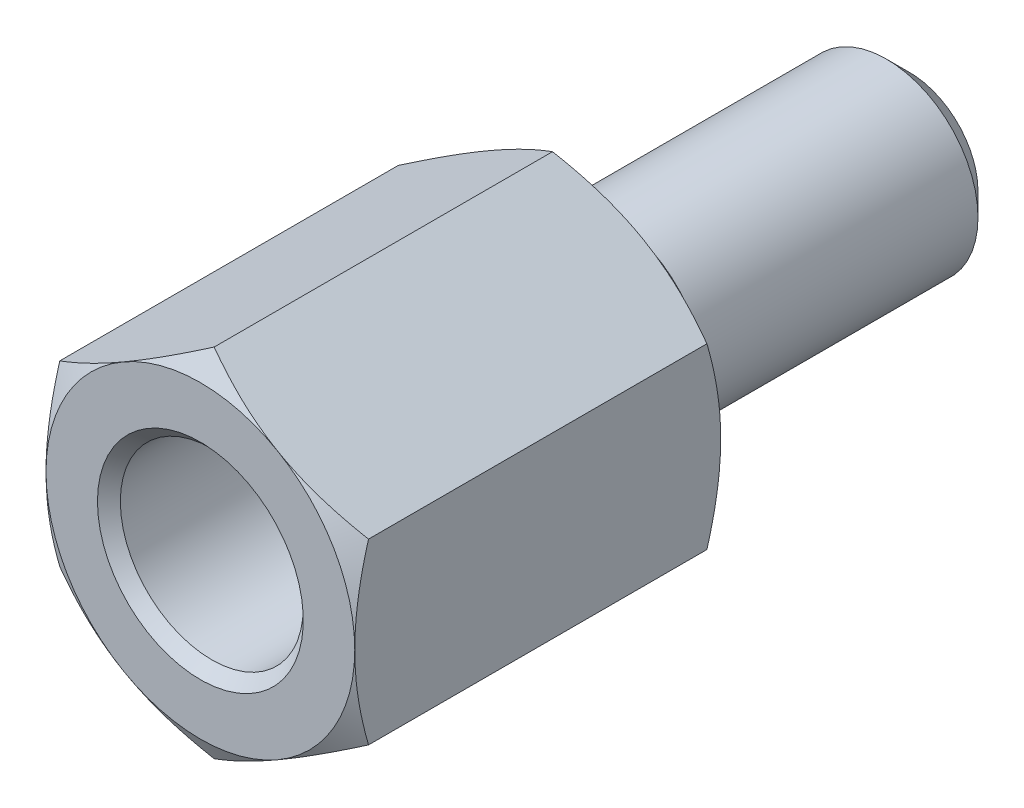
ISO-10303-21;
HEADER;
FILE_DESCRIPTION(('STEP AP214'),'2;1');
FILE_NAME('part.step','',(''),(''),'','','');
FILE_SCHEMA(('AUTOMOTIVE_DESIGN { 1 0 10303 214 1 1 1 1 }'));
ENDSEC;
DATA;
#1=APPLICATION_CONTEXT('core data for automotive mechanical design processes');
#2=APPLICATION_PROTOCOL_DEFINITION('international standard','automotive_design',2000,#1);
#3=PRODUCT_CONTEXT('',#1,'mechanical');
#4=PRODUCT('Part','Part','',(#3));
#5=PRODUCT_RELATED_PRODUCT_CATEGORY('part','',(#4));
#6=PRODUCT_DEFINITION_FORMATION('','',#4);
#7=PRODUCT_DEFINITION_CONTEXT('part definition',#1,'design');
#8=PRODUCT_DEFINITION('design','',#6,#7);
#9=PRODUCT_DEFINITION_SHAPE('','',#8);
#10=(LENGTH_UNIT() NAMED_UNIT(*) SI_UNIT(.MILLI.,.METRE.));
#11=(NAMED_UNIT(*) PLANE_ANGLE_UNIT() SI_UNIT($,.RADIAN.));
#12=(NAMED_UNIT(*) SI_UNIT($,.STERADIAN.) SOLID_ANGLE_UNIT());
#13=UNCERTAINTY_MEASURE_WITH_UNIT(LENGTH_MEASURE(1.E-05),#10,'distance_accuracy_value','');
#14=(GEOMETRIC_REPRESENTATION_CONTEXT(3) GLOBAL_UNCERTAINTY_ASSIGNED_CONTEXT((#13)) GLOBAL_UNIT_ASSIGNED_CONTEXT((#10,
#11,#12)) REPRESENTATION_CONTEXT('',''));
#15=CARTESIAN_POINT('',(0.,0.,0.));
#16=DIRECTION('',(0.,0.,1.));
#17=DIRECTION('',(1.,0.,0.));
#18=AXIS2_PLACEMENT_3D('',#15,#16,#17);
#19=CARTESIAN_POINT('',(16.,0.,0.));
#20=DIRECTION('',(0.,0.,-1.));
#21=DIRECTION('',(-1.,0.,0.));
#22=AXIS2_PLACEMENT_3D('',#19,#20,#21);
#23=PLANE('',#22);
#24=CARTESIAN_POINT('',(0.,0.,0.));
#25=DIRECTION('',(0.,0.,-1.));
#26=DIRECTION('',(-1.,0.,0.));
#27=AXIS2_PLACEMENT_3D('',#24,#25,#26);
#28=CIRCLE('',#27,13.5);
#29=CARTESIAN_POINT('',(-6.75,-11.6913429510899,0.));
#30=VERTEX_POINT('',#29);
#31=CARTESIAN_POINT('',(-13.5,0.,0.));
#32=VERTEX_POINT('',#31);
#33=EDGE_CURVE('E136',#30,#32,#28,.T.);
#34=ORIENTED_EDGE('',*,*,#33,.T.);
#35=CARTESIAN_POINT('',(-6.75,11.6913429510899,0.));
#36=VERTEX_POINT('',#35);
#37=EDGE_CURVE('E134',#32,#36,#28,.T.);
#38=ORIENTED_EDGE('',*,*,#37,.T.);
#39=CARTESIAN_POINT('',(6.75,11.6913429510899,0.));
#40=VERTEX_POINT('',#39);
#41=EDGE_CURVE('E113',#36,#40,#28,.T.);
#42=ORIENTED_EDGE('',*,*,#41,.T.);
#43=CARTESIAN_POINT('',(13.5,0.,0.));
#44=VERTEX_POINT('',#43);
#45=EDGE_CURVE('E103',#40,#44,#28,.T.);
#46=ORIENTED_EDGE('',*,*,#45,.T.);
#47=CARTESIAN_POINT('',(6.75,-11.6913429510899,0.));
#48=VERTEX_POINT('',#47);
#49=EDGE_CURVE('E29',#44,#48,#28,.T.);
#50=ORIENTED_EDGE('',*,*,#49,.T.);
#51=EDGE_CURVE('E37',#48,#30,#28,.T.);
#52=ORIENTED_EDGE('',*,*,#51,.T.);
#53=EDGE_LOOP('',(#34,#38,#42,#46,#50,#52));
#54=FACE_BOUND('',#53,.T.);
#55=CARTESIAN_POINT('',(0.,0.,0.));
#56=DIRECTION('',(0.,0.,1.));
#57=DIRECTION('',(1.,0.,0.));
#58=AXIS2_PLACEMENT_3D('',#55,#56,#57);
#59=CIRCLE('',#58,6.5);
#60=CARTESIAN_POINT('',(6.5,0.,0.));
#61=VERTEX_POINT('',#60);
#62=EDGE_CURVE('E252',#61,#61,#59,.T.);
#63=ORIENTED_EDGE('',*,*,#62,.T.);
#64=EDGE_LOOP('',(#63));
#65=FACE_BOUND('',#64,.T.);
#66=ADVANCED_FACE('F14',(#54,#65),#23,.T.);
#67=CARTESIAN_POINT('',(0.,0.,80.));
#68=DIRECTION('',(0.,0.,1.));
#69=DIRECTION('',(1.,0.,0.));
#70=AXIS2_PLACEMENT_3D('',#67,#68,#69);
#71=CYLINDRICAL_SURFACE('',#70,6.5);
#72=CARTESIAN_POINT('',(0.,0.,-4.));
#73=DIRECTION('',(0.,0.,1.));
#74=DIRECTION('',(1.,0.,0.));
#75=AXIS2_PLACEMENT_3D('',#72,#73,#74);
#76=CIRCLE('',#75,6.5);
#77=CARTESIAN_POINT('',(6.5,0.,-4.));
#78=VERTEX_POINT('',#77);
#79=EDGE_CURVE('E249',#78,#78,#76,.T.);
#80=ORIENTED_EDGE('',*,*,#79,.T.);
#81=EDGE_LOOP('',(#80));
#82=FACE_BOUND('',#81,.T.);
#83=ORIENTED_EDGE('',*,*,#62,.F.);
#84=EDGE_LOOP('',(#83));
#85=FACE_BOUND('',#84,.T.);
#86=ADVANCED_FACE('F331',(#82,#85),#71,.T.);
#87=CARTESIAN_POINT('',(6.5,0.,-4.));
#88=DIRECTION('',(0.,0.,1.));
#89=DIRECTION('',(1.,0.,0.));
#90=AXIS2_PLACEMENT_3D('',#87,#88,#89);
#91=PLANE('',#90);
#92=CARTESIAN_POINT('',(0.,0.,-4.));
#93=DIRECTION('',(0.,0.,1.));
#94=DIRECTION('',(1.,0.,0.));
#95=AXIS2_PLACEMENT_3D('',#92,#93,#94);
#96=CIRCLE('',#95,8.);
#97=CARTESIAN_POINT('',(8.,0.,-4.));
#98=VERTEX_POINT('',#97);
#99=EDGE_CURVE('E246',#98,#98,#96,.T.);
#100=ORIENTED_EDGE('',*,*,#99,.T.);
#101=EDGE_LOOP('',(#100));
#102=FACE_BOUND('',#101,.T.);
#103=ORIENTED_EDGE('',*,*,#79,.F.);
#104=EDGE_LOOP('',(#103));
#105=FACE_BOUND('',#104,.T.);
#106=ADVANCED_FACE('F336',(#102,#105),#91,.T.);
#107=CARTESIAN_POINT('',(0.,0.,80.));
#108=DIRECTION('',(0.,0.,1.));
#109=DIRECTION('',(1.,0.,0.));
#110=AXIS2_PLACEMENT_3D('',#107,#108,#109);
#111=CYLINDRICAL_SURFACE('',#110,8.);
#112=CARTESIAN_POINT('',(0.,0.,-28.));
#113=DIRECTION('',(0.,0.,1.));
#114=DIRECTION('',(1.,0.,0.));
#115=AXIS2_PLACEMENT_3D('',#112,#113,#114);
#116=CIRCLE('',#115,8.);
#117=CARTESIAN_POINT('',(8.,0.,-28.));
#118=VERTEX_POINT('',#117);
#119=EDGE_CURVE('E355',#118,#118,#116,.T.);
#120=ORIENTED_EDGE('',*,*,#119,.T.);
#121=EDGE_LOOP('',(#120));
#122=FACE_BOUND('',#121,.T.);
#123=ORIENTED_EDGE('',*,*,#99,.F.);
#124=EDGE_LOOP('',(#123));
#125=FACE_BOUND('',#124,.T.);
#126=ADVANCED_FACE('F415',(#122,#125),#111,.T.);
#127=CARTESIAN_POINT('',(0.,0.,-30.));
#128=DIRECTION('',(0.,0.,1.));
#129=DIRECTION('',(1.,0.,0.));
#130=AXIS2_PLACEMENT_3D('',#127,#128,#129);
#131=PLANE('',#130);
#132=CARTESIAN_POINT('',(0.,0.,-30.));
#133=DIRECTION('',(0.,0.,1.));
#134=DIRECTION('',(1.,0.,0.));
#135=AXIS2_PLACEMENT_3D('',#132,#133,#134);
#136=CIRCLE('',#135,6.);
#137=CARTESIAN_POINT('',(6.,0.,-30.));
#138=VERTEX_POINT('',#137);
#139=EDGE_CURVE('E352',#138,#138,#136,.F.);
#140=ORIENTED_EDGE('',*,*,#139,.T.);
#141=EDGE_LOOP('',(#140));
#142=FACE_BOUND('',#141,.T.);
#143=ADVANCED_FACE('F411',(#142),#131,.F.);
#144=CARTESIAN_POINT('',(0.,0.,4.12919548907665));
#145=DIRECTION('',(0.,0.,1.));
#146=DIRECTION('',(1.,0.,0.));
#147=AXIS2_PLACEMENT_3D('',#144,#145,#146);
#148=CONICAL_SURFACE('',#147,20.6519763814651,1.0471975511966);
#149=ORIENTED_EDGE('',*,*,#41,.F.);
#150=CARTESIAN_POINT('',(-13.5002,7.79411316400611,1.20583803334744));
#151=CARTESIAN_POINT('',(-13.2034751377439,7.96542734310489,1.10693600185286));
#152=CARTESIAN_POINT('',(-12.9055928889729,8.13740973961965,1.01252193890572));
#153=CARTESIAN_POINT('',(-12.3074397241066,8.48275363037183,0.833917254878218));
#154=CARTESIAN_POINT('',(-12.0071680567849,8.65611555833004,0.749729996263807));
#155=CARTESIAN_POINT('',(-11.403655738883,9.00455355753,0.592710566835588));
#156=CARTESIAN_POINT('',(-11.1004098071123,9.17963267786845,0.51990526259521));
#157=CARTESIAN_POINT('',(-10.4918107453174,9.53100751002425,0.387213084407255));
#158=CARTESIAN_POINT('',(-10.1864577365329,9.70730315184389,0.32732547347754));
#159=CARTESIAN_POINT('',(-9.58146884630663,10.0565936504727,0.223015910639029));
#160=CARTESIAN_POINT('',(-9.28187788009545,10.2295625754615,0.178248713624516));
#161=CARTESIAN_POINT('',(-8.68132315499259,10.5762930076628,0.103183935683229));
#162=CARTESIAN_POINT('',(-8.38035936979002,10.7500545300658,0.0728866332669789));
#163=CARTESIAN_POINT('',(-7.77792621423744,11.0978694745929,0.0275266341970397));
#164=CARTESIAN_POINT('',(-7.4764578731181,11.2719223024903,0.0124458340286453));
#165=CARTESIAN_POINT('',(-6.87324289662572,11.6201886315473,-0.00215683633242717));
#166=CARTESIAN_POINT('',(-6.57149627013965,11.7944021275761,-0.00167918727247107));
#167=CARTESIAN_POINT('',(-6.00738189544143,12.1200937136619,0.0137483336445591));
#168=CARTESIAN_POINT('',(-5.74497394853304,12.2715950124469,0.0268164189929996));
#169=CARTESIAN_POINT('',(-5.2207616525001,12.5742491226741,0.0644725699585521));
#170=CARTESIAN_POINT('',(-4.95895734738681,12.7254019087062,0.089061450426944));
#171=CARTESIAN_POINT('',(-4.43609453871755,13.0272768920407,0.149330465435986));
#172=CARTESIAN_POINT('',(-4.17503683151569,13.1779986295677,0.185019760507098));
#173=CARTESIAN_POINT('',(-3.65414530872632,13.4787354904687,0.266863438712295));
#174=CARTESIAN_POINT('',(-3.39431157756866,13.6287505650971,0.313018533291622));
#175=CARTESIAN_POINT('',(-2.60557180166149,14.0841296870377,0.468349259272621));
#176=CARTESIAN_POINT('',(-2.07894982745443,14.3881750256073,0.593013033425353));
#177=CARTESIAN_POINT('',(-1.03355849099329,14.9917319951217,0.875948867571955));
#178=CARTESIAN_POINT('',(-0.514775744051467,15.2912513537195,1.03415447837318));
#179=CARTESIAN_POINT('',(0.000200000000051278,15.5885727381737,1.20583803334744));
#180=B_SPLINE_CURVE_WITH_KNOTS('',3,(#150,#151,#152,#153,#154,#155,#156,#157,#158,#159,#160,
#161,#162,#163,#164,#165,#166,#167,#168,#169,#170,#171,#172,#173,#174,#175,#176,#177,#178,#179),
.UNSPECIFIED.,.F.,.F.,(4,2,2,2,2,2,2,2,2,2,2,2,2,2,4),(0.,1.06987949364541,2.14010980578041,
3.21282939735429,4.28548777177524,5.33167033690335,6.3778730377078,7.42282956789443,
8.46775380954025,9.37738732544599,10.2870851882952,11.1975357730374,12.1080482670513,
13.9691139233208,15.8265265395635),.UNSPECIFIED.);
#181=CARTESIAN_POINT('',(0.,15.5884572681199,1.20577136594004));
#182=VERTEX_POINT('',#181);
#183=EDGE_CURVE('E121',#36,#182,#180,.T.);
#184=ORIENTED_EDGE('',*,*,#183,.T.);
#185=CARTESIAN_POINT('',(13.5002,7.79411316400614,1.20583803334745));
#186=CARTESIAN_POINT('',(13.2034751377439,7.96542734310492,1.10693600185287));
#187=CARTESIAN_POINT('',(12.9055928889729,8.13740973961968,1.01252193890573));
#188=CARTESIAN_POINT('',(12.3074397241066,8.48275363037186,0.833917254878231));
#189=CARTESIAN_POINT('',(12.0071680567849,8.65611555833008,0.749729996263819));
#190=CARTESIAN_POINT('',(11.403655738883,9.00455355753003,0.592710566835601));
#191=CARTESIAN_POINT('',(11.1004098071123,9.17963267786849,0.519905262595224));
#192=CARTESIAN_POINT('',(10.4918107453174,9.53100751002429,0.387213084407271));
#193=CARTESIAN_POINT('',(10.1864577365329,9.70730315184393,0.327325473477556));
#194=CARTESIAN_POINT('',(9.58146884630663,10.0565936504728,0.223015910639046));
#195=CARTESIAN_POINT('',(9.28187788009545,10.2295625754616,0.178248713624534));
#196=CARTESIAN_POINT('',(8.68132315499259,10.5762930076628,0.103183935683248));
#197=CARTESIAN_POINT('',(8.38035936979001,10.7500545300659,0.0728866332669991));
#198=CARTESIAN_POINT('',(7.77792621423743,11.0978694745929,0.0275266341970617));
#199=CARTESIAN_POINT('',(7.47645787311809,11.2719223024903,0.0124458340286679));
#200=CARTESIAN_POINT('',(6.87324289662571,11.6201886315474,-0.00215683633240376));
#201=CARTESIAN_POINT('',(6.57149627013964,11.7944021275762,-0.00167918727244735));
#202=CARTESIAN_POINT('',(6.00738189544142,12.1200937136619,0.0137483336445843));
#203=CARTESIAN_POINT('',(5.74497394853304,12.271595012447,0.0268164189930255));
#204=CARTESIAN_POINT('',(5.22076165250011,12.5742491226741,0.0644725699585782));
#205=CARTESIAN_POINT('',(4.95895734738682,12.7254019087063,0.0890614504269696));
#206=CARTESIAN_POINT('',(4.43609453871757,13.0272768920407,0.149330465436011));
#207=CARTESIAN_POINT('',(4.17503683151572,13.1779986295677,0.185019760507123));
#208=CARTESIAN_POINT('',(3.65414530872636,13.4787354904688,0.266863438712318));
#209=CARTESIAN_POINT('',(3.39431157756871,13.6287505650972,0.313018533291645));
#210=CARTESIAN_POINT('',(2.60557180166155,14.0841296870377,0.46834925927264));
#211=CARTESIAN_POINT('',(2.07894982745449,14.3881750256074,0.593013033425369));
#212=CARTESIAN_POINT('',(1.03355849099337,14.9917319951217,0.875948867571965));
#213=CARTESIAN_POINT('',(0.51477574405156,15.2912513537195,1.03415447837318));
#214=CARTESIAN_POINT('',(-0.000199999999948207,15.5885727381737,1.20583803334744));
#215=B_SPLINE_CURVE_WITH_KNOTS('',3,(#185,#186,#187,#188,#189,#190,#191,#192,#193,#194,#195,
#196,#197,#198,#199,#200,#201,#202,#203,#204,#205,#206,#207,#208,#209,#210,#211,#212,#213,#214),
.UNSPECIFIED.,.F.,.F.,(4,2,2,2,2,2,2,2,2,2,2,2,2,2,4),(0.,1.06987949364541,2.14010980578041,
3.21282939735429,4.28548777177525,5.33167033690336,6.37787303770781,7.42282956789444,
8.46775380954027,9.377387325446,10.2870851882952,11.1975357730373,12.1080482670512,
13.9691139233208,15.8265265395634),.UNSPECIFIED.);
#216=EDGE_CURVE('E118',#40,#182,#215,.T.);
#217=ORIENTED_EDGE('',*,*,#216,.F.);
#218=EDGE_LOOP('',(#149,#184,#217));
#219=FACE_BOUND('',#218,.T.);
#220=ADVANCED_FACE('F119',(#219),#148,.T.);
#221=CARTESIAN_POINT('',(-13.5,-21.0796880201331,6.65802894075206));
#222=CARTESIAN_POINT('',(-13.5,-20.7842796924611,6.5144067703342));
#223=CARTESIAN_POINT('',(-13.5,-20.4885285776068,6.3714899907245));
#224=CARTESIAN_POINT('',(-13.5,-19.8962692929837,6.0872266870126));
#225=CARTESIAN_POINT('',(-13.5,-19.5997611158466,5.94588017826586));
#226=CARTESIAN_POINT('',(-13.5,-18.7089167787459,5.52439893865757));
#227=CARTESIAN_POINT('',(-13.5,-18.1133459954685,5.24686402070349));
#228=CARTESIAN_POINT('',(-13.5,-16.9150936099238,4.69891440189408));
#229=CARTESIAN_POINT('',(-13.5,-16.3123910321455,4.4285454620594));
#230=CARTESIAN_POINT('',(-13.5,-15.1022429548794,3.89867712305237));
#231=CARTESIAN_POINT('',(-13.5,-14.4947976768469,3.63917721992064));
#232=CARTESIAN_POINT('',(-13.5,-13.2540156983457,3.12556391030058));
#233=CARTESIAN_POINT('',(-13.5,-12.6204869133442,2.8719121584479));
#234=CARTESIAN_POINT('',(-13.5,-11.3460661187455,2.38345990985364));
#235=CARTESIAN_POINT('',(-13.5,-10.7051732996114,2.14866150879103));
#236=CARTESIAN_POINT('',(-13.5,-9.41617942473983,1.70397888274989));
#237=CARTESIAN_POINT('',(-13.5,-8.76809548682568,1.49404543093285));
#238=CARTESIAN_POINT('',(-13.5,-7.46257085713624,1.10572178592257));
#239=CARTESIAN_POINT('',(-13.5,-6.80513313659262,0.927321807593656));
#240=CARTESIAN_POINT('',(-13.5,-5.8136687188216,0.690248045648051));
#241=CARTESIAN_POINT('',(-13.5,-5.48323130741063,0.616475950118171));
#242=CARTESIAN_POINT('',(-13.5,-4.82007232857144,0.479970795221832));
#243=CARTESIAN_POINT('',(-13.5,-4.48735080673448,0.417237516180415));
#244=CARTESIAN_POINT('',(-13.5,-3.81984256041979,0.303908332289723));
#245=CARTESIAN_POINT('',(-13.5,-3.48505587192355,0.253312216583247));
#246=CARTESIAN_POINT('',(-13.5,-2.8137601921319,0.165261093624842));
#247=CARTESIAN_POINT('',(-13.5,-2.47725126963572,0.127805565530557));
#248=CARTESIAN_POINT('',(-13.5,-1.80743717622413,0.0672574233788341));
#249=CARTESIAN_POINT('',(-13.5,-1.47414873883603,0.043980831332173));
#250=CARTESIAN_POINT('',(-13.5,-0.806886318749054,0.0115503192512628));
#251=CARTESIAN_POINT('',(-13.5,-0.472912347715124,0.00239616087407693));
#252=CARTESIAN_POINT('',(-13.5,0.195123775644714,-0.00157114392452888));
#253=CARTESIAN_POINT('',(-13.5,0.529185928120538,0.0036157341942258));
#254=CARTESIAN_POINT('',(-13.5,1.19679054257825,0.0282022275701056));
#255=CARTESIAN_POINT('',(-13.5,1.53033298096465,0.0476024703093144));
#256=CARTESIAN_POINT('',(-13.5,2.32763796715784,0.110549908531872));
#257=CARTESIAN_POINT('',(-13.5,2.79089631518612,0.160601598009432));
#258=CARTESIAN_POINT('',(-13.5,3.71407151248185,0.28543110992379));
#259=CARTESIAN_POINT('',(-13.5,4.17398791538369,0.360212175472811));
#260=CARTESIAN_POINT('',(-13.5,5.09000797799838,0.531840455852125));
#261=CARTESIAN_POINT('',(-13.5,5.54610846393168,0.628704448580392));
#262=CARTESIAN_POINT('',(-13.5,6.45378183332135,0.841534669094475));
#263=CARTESIAN_POINT('',(-13.5,6.90535477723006,0.957500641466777));
#264=CARTESIAN_POINT('',(-13.5,7.81398939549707,1.20846889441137));
#265=CARTESIAN_POINT('',(-13.5,8.27094908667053,1.34383784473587));
#266=CARTESIAN_POINT('',(-13.5,9.18036911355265,1.62885164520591));
#267=CARTESIAN_POINT('',(-13.5,9.63282941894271,1.77849659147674));
#268=CARTESIAN_POINT('',(-13.5,10.5334692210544,2.08966113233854));
#269=CARTESIAN_POINT('',(-13.5,10.9816500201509,2.25117697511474));
#270=CARTESIAN_POINT('',(-13.5,11.8742787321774,2.5841548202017));
#271=CARTESIAN_POINT('',(-13.5,12.3187266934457,2.75561669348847));
#272=CARTESIAN_POINT('',(-13.5,13.3848955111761,3.17846296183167));
#273=CARTESIAN_POINT('',(-13.5,14.0049966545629,3.43392565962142));
#274=CARTESIAN_POINT('',(-13.5,15.2397561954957,3.95772128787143));
#275=CARTESIAN_POINT('',(-13.5,15.8544142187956,4.22605509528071));
#276=CARTESIAN_POINT('',(-13.5,17.0793277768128,4.77295979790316));
#277=CARTESIAN_POINT('',(-13.5,17.6895821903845,5.05153319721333));
#278=CARTESIAN_POINT('',(-13.5,18.9062890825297,5.61680417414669));
#279=CARTESIAN_POINT('',(-13.5,19.5127416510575,5.90350155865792));
#280=CARTESIAN_POINT('',(-13.5,20.7231998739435,6.48381039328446));
#281=CARTESIAN_POINT('',(-13.5,21.3272018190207,6.77742956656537));
#282=CARTESIAN_POINT('',(-13.5,22.5325574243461,7.37005371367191));
#283=CARTESIAN_POINT('',(-13.5,23.1339110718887,7.66905871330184));
#284=CARTESIAN_POINT('',(-13.5,24.3342999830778,8.27147100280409));
#285=CARTESIAN_POINT('',(-13.5,24.9333355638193,8.57487766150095));
#286=CARTESIAN_POINT('',(-13.5,26.1295140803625,9.18540124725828));
#287=CARTESIAN_POINT('',(-13.5,26.7266570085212,9.49251818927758));
#288=CARTESIAN_POINT('',(-13.5,28.4122253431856,10.3649831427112));
#289=CARTESIAN_POINT('',(-13.5,29.4987723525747,10.9339599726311));
#290=CARTESIAN_POINT('',(-13.5,31.6678354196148,12.0796289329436));
#291=CARTESIAN_POINT('',(-13.5,32.7503513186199,12.6563213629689));
#292=CARTESIAN_POINT('',(-13.5,34.9093653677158,13.8140581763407));
#293=CARTESIAN_POINT('',(-13.5,35.9858718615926,14.3950870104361));
#294=CARTESIAN_POINT('',(-13.5,37.5987388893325,15.270040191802));
#295=CARTESIAN_POINT('',(-13.5,38.1360303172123,15.5622511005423));
#296=CARTESIAN_POINT('',(-13.5,39.2100549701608,16.1476950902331));
#297=CARTESIAN_POINT('',(-13.5,39.7467881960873,16.4409281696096));
#298=CARTESIAN_POINT('',(-13.5,40.2832742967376,16.7346128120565));
#299=B_SPLINE_CURVE_WITH_KNOTS('',3,(#221,#222,#223,#224,#225,#226,#227,#228,#229,#230,#231,
#232,#233,#234,#235,#236,#237,#238,#239,#240,#241,#242,#243,#244,#245,#246,#247,#248,#249,#250,
#251,#252,#253,#254,#255,#256,#257,#258,#259,#260,#261,#262,#263,#264,#265,#266,#267,#268,#269,
#270,#271,#272,#273,#274,#275,#276,#277,#278,#279,#280,#281,#282,#283,#284,#285,#286,#287,#288,
#289,#290,#291,#292,#293,#294,#295,#296,#297,#298),.UNSPECIFIED.,.F.,.F.,(4,2,2,2,2,2,2,2,2,2,2,
2,2,2,2,2,2,2,2,2,2,2,2,2,2,2,2,2,2,2,2,2,2,2,2,2,2,2,4),(0.,0.985412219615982,1.97083406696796,
3.94196204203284,5.92358161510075,7.90510920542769,9.9521419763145,11.9994019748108,
14.0425386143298,16.0850401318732,17.1006025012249,18.1161446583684,19.1316691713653,
20.1471534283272,21.149163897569,22.1511574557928,23.1531527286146,24.155192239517,
25.5522854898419,26.9495620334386,28.3479037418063,29.7462267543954,31.1757151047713,
32.6052130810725,34.0342611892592,35.4632907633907,37.4750749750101,39.4869964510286,
41.4994132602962,43.5117822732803,45.5265141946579,47.5412557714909,49.5557112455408,
51.5701748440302,55.2496482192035,58.9292649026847,62.5991471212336,64.4339824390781,
66.2688149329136),.UNSPECIFIED.);
#300=CARTESIAN_POINT('',(-13.5,7.79422863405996,1.20577136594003));
#301=VERTEX_POINT('',#300);
#302=EDGE_CURVE('E135',#32,#301,#299,.T.);
#303=ORIENTED_EDGE('',*,*,#302,.T.);
#304=EDGE_CURVE('E262',#301,#36,#180,.T.);
#305=ORIENTED_EDGE('',*,*,#304,.T.);
#306=ORIENTED_EDGE('',*,*,#37,.F.);
#307=EDGE_LOOP('',(#303,#305,#306));
#308=FACE_BOUND('',#307,.T.);
#309=ADVANCED_FACE('F154',(#308),#148,.T.);
#310=CARTESIAN_POINT('',(-13.5,-7.79422863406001,1.20577136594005));
#311=VERTEX_POINT('',#310);
#312=EDGE_CURVE('E145',#311,#32,#299,.T.);
#313=ORIENTED_EDGE('',*,*,#312,.T.);
#314=ORIENTED_EDGE('',*,*,#33,.F.);
#315=CARTESIAN_POINT('',(-13.5002,-7.79411316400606,1.20583803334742));
#316=CARTESIAN_POINT('',(-13.2034751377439,-7.96542734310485,1.10693600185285));
#317=CARTESIAN_POINT('',(-12.9055928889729,-8.1374097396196,1.0125219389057));
#318=CARTESIAN_POINT('',(-12.3074397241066,-8.48275363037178,0.833917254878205));
#319=CARTESIAN_POINT('',(-12.0071680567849,-8.65611555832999,0.749729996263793));
#320=CARTESIAN_POINT('',(-11.403655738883,-9.00455355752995,0.592710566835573));
#321=CARTESIAN_POINT('',(-11.1004098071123,-9.1796326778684,0.519905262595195));
#322=CARTESIAN_POINT('',(-10.4918107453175,-9.5310075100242,0.387213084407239));
#323=CARTESIAN_POINT('',(-10.1864577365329,-9.70730315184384,0.327325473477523));
#324=CARTESIAN_POINT('',(-9.58146884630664,-10.0565936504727,0.223015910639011));
#325=CARTESIAN_POINT('',(-9.28187788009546,-10.2295625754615,0.178248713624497));
#326=CARTESIAN_POINT('',(-8.6813231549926,-10.5762930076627,0.103183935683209));
#327=CARTESIAN_POINT('',(-8.38035936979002,-10.7500545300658,0.0728866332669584));
#328=CARTESIAN_POINT('',(-7.77792621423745,-11.0978694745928,0.0275266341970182));
#329=CARTESIAN_POINT('',(-7.47645787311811,-11.2719223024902,0.0124458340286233));
#330=CARTESIAN_POINT('',(-6.87324289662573,-11.6201886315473,-0.00215683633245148));
#331=CARTESIAN_POINT('',(-6.57149627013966,-11.7944021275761,-0.00167918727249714));
#332=CARTESIAN_POINT('',(-6.00738189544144,-12.1200937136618,0.0137483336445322));
#333=CARTESIAN_POINT('',(-5.74497394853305,-12.2715950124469,0.0268164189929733));
#334=CARTESIAN_POINT('',(-5.22076165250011,-12.574249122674,0.0644725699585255));
#335=CARTESIAN_POINT('',(-4.95895734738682,-12.7254019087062,0.0890614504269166));
#336=CARTESIAN_POINT('',(-4.43609453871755,-13.0272768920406,0.149330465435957));
#337=CARTESIAN_POINT('',(-4.1750368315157,-13.1779986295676,0.185019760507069));
#338=CARTESIAN_POINT('',(-3.65414530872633,-13.4787354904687,0.266863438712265));
#339=CARTESIAN_POINT('',(-3.39431157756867,-13.6287505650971,0.313018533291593));
#340=CARTESIAN_POINT('',(-2.60557180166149,-14.0841296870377,0.468349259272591));
#341=CARTESIAN_POINT('',(-2.07894982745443,-14.3881750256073,0.593013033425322));
#342=CARTESIAN_POINT('',(-1.03355849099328,-14.9917319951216,0.875948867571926));
#343=CARTESIAN_POINT('',(-0.514775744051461,-15.2912513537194,1.03415447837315));
#344=CARTESIAN_POINT('',(0.000200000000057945,-15.5885727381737,1.20583803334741));
#345=B_SPLINE_CURVE_WITH_KNOTS('',3,(#315,#316,#317,#318,#319,#320,#321,#322,#323,#324,#325,
#326,#327,#328,#329,#330,#331,#332,#333,#334,#335,#336,#337,#338,#339,#340,#341,#342,#343,#344),
.UNSPECIFIED.,.F.,.F.,(4,2,2,2,2,2,2,2,2,2,2,2,2,2,4),(0.,1.0698794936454,2.14010980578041,
3.21282939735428,4.28548777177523,5.33167033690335,6.37787303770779,7.42282956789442,
8.46775380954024,9.37738732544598,10.2870851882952,11.1975357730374,12.1080482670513,
13.9691139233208,15.8265265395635),.UNSPECIFIED.);
#346=EDGE_CURVE('E124',#311,#30,#345,.T.);
#347=ORIENTED_EDGE('',*,*,#346,.F.);
#348=EDGE_LOOP('',(#313,#314,#347));
#349=FACE_BOUND('',#348,.T.);
#350=ADVANCED_FACE('F158',(#349),#148,.T.);
#351=CARTESIAN_POINT('',(13.5002,-7.79411316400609,1.20583803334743));
#352=CARTESIAN_POINT('',(13.203475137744,-7.96542734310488,1.10693600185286));
#353=CARTESIAN_POINT('',(12.9055928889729,-8.13740973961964,1.01252193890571));
#354=CARTESIAN_POINT('',(12.3074397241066,-8.48275363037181,0.833917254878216));
#355=CARTESIAN_POINT('',(12.0071680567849,-8.65611555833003,0.749729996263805));
#356=CARTESIAN_POINT('',(11.403655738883,-9.00455355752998,0.592710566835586));
#357=CARTESIAN_POINT('',(11.1004098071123,-9.17963267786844,0.519905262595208));
#358=CARTESIAN_POINT('',(10.4918107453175,-9.53100751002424,0.387213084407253));
#359=CARTESIAN_POINT('',(10.1864577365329,-9.70730315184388,0.327325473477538));
#360=CARTESIAN_POINT('',(9.58146884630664,-10.0565936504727,0.223015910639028));
#361=CARTESIAN_POINT('',(9.28187788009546,-10.2295625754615,0.178248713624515));
#362=CARTESIAN_POINT('',(8.6813231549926,-10.5762930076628,0.103183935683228));
#363=CARTESIAN_POINT('',(8.38035936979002,-10.7500545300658,0.0728866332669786));
#364=CARTESIAN_POINT('',(7.77792621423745,-11.0978694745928,0.0275266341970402));
#365=CARTESIAN_POINT('',(7.4764578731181,-11.2719223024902,0.0124458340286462));
#366=CARTESIAN_POINT('',(6.87324289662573,-11.6201886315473,-0.00215683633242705));
#367=CARTESIAN_POINT('',(6.57149627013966,-11.7944021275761,-0.00167918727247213));
#368=CARTESIAN_POINT('',(6.00738189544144,-12.1200937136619,0.0137483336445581));
#369=CARTESIAN_POINT('',(5.74497394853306,-12.2715950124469,0.0268164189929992));
#370=CARTESIAN_POINT('',(5.22076165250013,-12.5742491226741,0.0644725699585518));
#371=CARTESIAN_POINT('',(4.95895734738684,-12.7254019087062,0.0890614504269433));
#372=CARTESIAN_POINT('',(4.43609453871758,-13.0272768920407,0.149330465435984));
#373=CARTESIAN_POINT('',(4.17503683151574,-13.1779986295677,0.185019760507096));
#374=CARTESIAN_POINT('',(3.65414530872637,-13.4787354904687,0.266863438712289));
#375=CARTESIAN_POINT('',(3.39431157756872,-13.6287505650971,0.313018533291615));
#376=CARTESIAN_POINT('',(2.60557180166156,-14.0841296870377,0.468349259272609));
#377=CARTESIAN_POINT('',(2.0789498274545,-14.3881750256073,0.593013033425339));
#378=CARTESIAN_POINT('',(1.03355849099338,-14.9917319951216,0.875948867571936));
#379=CARTESIAN_POINT('',(0.51477574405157,-15.2912513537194,1.03415447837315));
#380=CARTESIAN_POINT('',(-0.000199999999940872,-15.5885727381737,1.20583803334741));
#381=B_SPLINE_CURVE_WITH_KNOTS('',3,(#351,#352,#353,#354,#355,#356,#357,#358,#359,#360,#361,
#362,#363,#364,#365,#366,#367,#368,#369,#370,#371,#372,#373,#374,#375,#376,#377,#378,#379,#380),
.UNSPECIFIED.,.F.,.F.,(4,2,2,2,2,2,2,2,2,2,2,2,2,2,4),(0.,1.0698794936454,2.14010980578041,
3.21282939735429,4.28548777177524,5.33167033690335,6.3778730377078,7.42282956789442,
8.46775380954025,9.37738732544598,10.2870851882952,11.1975357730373,12.1080482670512,
13.9691139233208,15.8265265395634),.UNSPECIFIED.);
#382=CARTESIAN_POINT('',(0.,-15.5884572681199,1.20577136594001));
#383=VERTEX_POINT('',#382);
#384=EDGE_CURVE('E184',#48,#383,#381,.T.);
#385=ORIENTED_EDGE('',*,*,#384,.T.);
#386=EDGE_CURVE('E130',#30,#383,#345,.T.);
#387=ORIENTED_EDGE('',*,*,#386,.F.);
#388=ORIENTED_EDGE('',*,*,#51,.F.);
#389=EDGE_LOOP('',(#385,#387,#388));
#390=FACE_BOUND('',#389,.T.);
#391=ADVANCED_FACE('F161',(#390),#148,.T.);
#392=CARTESIAN_POINT('',(13.5,-7.79422863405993,1.20577136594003));
#393=VERTEX_POINT('',#392);
#394=EDGE_CURVE('E190',#393,#48,#381,.T.);
#395=ORIENTED_EDGE('',*,*,#394,.T.);
#396=ORIENTED_EDGE('',*,*,#49,.F.);
#397=CARTESIAN_POINT('',(13.5,-21.0796880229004,6.65802894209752));
#398=CARTESIAN_POINT('',(13.5,-20.7842796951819,6.51440677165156));
#399=CARTESIAN_POINT('',(13.5,-20.4885285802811,6.37148999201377));
#400=CARTESIAN_POINT('',(13.5,-19.8962692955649,6.08722668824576));
#401=CARTESIAN_POINT('',(13.5,-19.5997611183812,5.94588017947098));
#402=CARTESIAN_POINT('',(13.5,-18.7089167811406,5.52439893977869));
#403=CARTESIAN_POINT('',(13.5,-18.1133459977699,5.24686402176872));
#404=CARTESIAN_POINT('',(13.5,-16.915093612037,4.69891440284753));
#405=CARTESIAN_POINT('',(13.5,-16.3123910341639,4.42854546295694));
#406=CARTESIAN_POINT('',(13.5,-15.1022429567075,3.89867712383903));
#407=CARTESIAN_POINT('',(13.5,-14.4947976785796,3.63917722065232));
#408=CARTESIAN_POINT('',(13.5,-13.25401569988,3.12556391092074));
#409=CARTESIAN_POINT('',(13.5,-12.6204869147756,2.87191215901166));
#410=CARTESIAN_POINT('',(13.5,-11.3460661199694,2.38345991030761));
#411=CARTESIAN_POINT('',(13.5,-10.7051733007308,2.14866150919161));
#412=CARTESIAN_POINT('',(13.5,-9.4161794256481,1.70397888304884));
#413=CARTESIAN_POINT('',(13.5,-8.76809548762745,1.49404543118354));
#414=CARTESIAN_POINT('',(13.5,-7.46257085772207,1.10572178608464));
#415=CARTESIAN_POINT('',(13.5,-6.805133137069,0.92732180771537));
#416=CARTESIAN_POINT('',(13.5,-5.81366871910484,0.690248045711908));
#417=CARTESIAN_POINT('',(13.5,-5.48323130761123,0.616475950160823));
#418=CARTESIAN_POINT('',(13.5,-4.82007232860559,0.479970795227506));
#419=CARTESIAN_POINT('',(13.5,-4.48735080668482,0.417237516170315));
#420=CARTESIAN_POINT('',(13.5,-3.81984256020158,0.30390833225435));
#421=CARTESIAN_POINT('',(13.5,-3.48505587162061,0.253312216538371));
#422=CARTESIAN_POINT('',(13.5,-2.81376019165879,0.165261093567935));
#423=CARTESIAN_POINT('',(13.5,-2.47725126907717,0.12780556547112));
#424=CARTESIAN_POINT('',(13.5,-1.80743717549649,0.0672574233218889));
#425=CARTESIAN_POINT('',(13.5,-1.47414873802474,0.0439808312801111));
#426=CARTESIAN_POINT('',(13.5,-0.806886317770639,0.0115503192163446));
#427=CARTESIAN_POINT('',(13.5,-0.472912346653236,0.00239616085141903));
#428=CARTESIAN_POINT('',(13.5,0.195123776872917,-0.00157114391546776));
#429=CARTESIAN_POINT('',(13.5,0.529185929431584,0.00361573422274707));
#430=CARTESIAN_POINT('',(13.5,1.1967905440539,0.0282022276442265));
#431=CARTESIAN_POINT('',(13.5,1.53033298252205,0.0476024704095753));
#432=CARTESIAN_POINT('',(13.5,2.32763796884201,0.110549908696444));
#433=CARTESIAN_POINT('',(13.5,2.79089631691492,0.160601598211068));
#434=CARTESIAN_POINT('',(13.5,3.71407151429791,0.285431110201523));
#435=CARTESIAN_POINT('',(13.5,4.17398791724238,0.360212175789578));
#436=CARTESIAN_POINT('',(13.5,5.09000797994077,0.531840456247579));
#437=CARTESIAN_POINT('',(13.5,5.54610846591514,0.628704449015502));
#438=CARTESIAN_POINT('',(13.5,6.45378183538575,0.841534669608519));
#439=CARTESIAN_POINT('',(13.5,6.90535477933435,0.957500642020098));
#440=CARTESIAN_POINT('',(13.5,7.81398939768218,1.20846889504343));
#441=CARTESIAN_POINT('',(13.5,8.27094908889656,1.3438378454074));
#442=CARTESIAN_POINT('',(13.5,9.18036911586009,1.62885164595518));
#443=CARTESIAN_POINT('',(13.5,9.63282942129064,1.77849659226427));
#444=CARTESIAN_POINT('',(13.5,10.533469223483,2.08966113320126));
#445=CARTESIAN_POINT('',(13.5,10.9816500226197,2.25117697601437));
#446=CARTESIAN_POINT('',(13.5,11.8742787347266,2.5841548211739));
#447=CARTESIAN_POINT('',(13.5,12.3187266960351,2.75561669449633));
#448=CARTESIAN_POINT('',(13.5,13.3848955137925,3.17846296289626));
#449=CARTESIAN_POINT('',(13.5,14.0049966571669,3.43392566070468));
#450=CARTESIAN_POINT('',(13.5,15.2397561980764,3.95772128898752));
#451=CARTESIAN_POINT('',(13.5,15.8544142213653,4.22605509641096));
#452=CARTESIAN_POINT('',(13.5,17.0793277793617,4.77295979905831));
#453=CARTESIAN_POINT('',(13.5,17.6895821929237,5.0515331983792));
#454=CARTESIAN_POINT('',(13.5,18.9062890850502,5.61680417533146));
#455=CARTESIAN_POINT('',(13.5,19.5127416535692,5.90350155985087));
#456=CARTESIAN_POINT('',(13.5,20.723199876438,6.48381039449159));
#457=CARTESIAN_POINT('',(13.5,21.3272018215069,6.77742956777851));
#458=CARTESIAN_POINT('',(13.5,22.5325574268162,7.37005371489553));
#459=CARTESIAN_POINT('',(13.5,23.133911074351,7.66905871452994));
#460=CARTESIAN_POINT('',(13.5,24.3342999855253,8.27147100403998));
#461=CARTESIAN_POINT('',(13.5,24.9333355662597,8.57487766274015));
#462=CARTESIAN_POINT('',(13.5,26.1295140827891,9.18540124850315));
#463=CARTESIAN_POINT('',(13.5,26.7266570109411,9.49251819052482));
#464=CARTESIAN_POINT('',(13.5,28.4122253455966,10.3649831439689));
#465=CARTESIAN_POINT('',(13.5,29.4987723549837,10.9339599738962));
#466=CARTESIAN_POINT('',(13.5,31.6678354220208,12.0796289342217));
#467=CARTESIAN_POINT('',(13.5,32.7503513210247,12.6563213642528));
#468=CARTESIAN_POINT('',(13.5,34.9093653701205,13.8140581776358));
#469=CARTESIAN_POINT('',(13.5,35.9858718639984,14.3950870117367));
#470=CARTESIAN_POINT('',(13.5,37.5987388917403,15.2700401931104));
#471=CARTESIAN_POINT('',(13.5,38.1360303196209,15.5622511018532));
#472=CARTESIAN_POINT('',(13.5,39.2100549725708,16.1476950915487));
#473=CARTESIAN_POINT('',(13.5,39.7467881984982,16.4409281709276));
#474=CARTESIAN_POINT('',(13.5,40.2832742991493,16.7346128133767));
#475=B_SPLINE_CURVE_WITH_KNOTS('',3,(#397,#398,#399,#400,#401,#402,#403,#404,#405,#406,#407,
#408,#409,#410,#411,#412,#413,#414,#415,#416,#417,#418,#419,#420,#421,#422,#423,#424,#425,#426,
#427,#428,#429,#430,#431,#432,#433,#434,#435,#436,#437,#438,#439,#440,#441,#442,#443,#444,#445,
#446,#447,#448,#449,#450,#451,#452,#453,#454,#455,#456,#457,#458,#459,#460,#461,#462,#463,#464,
#465,#466,#467,#468,#469,#470,#471,#472,#473,#474),.UNSPECIFIED.,.F.,.F.,(4,2,2,2,2,2,2,2,2,2,2,
2,2,2,2,2,2,2,2,2,2,2,2,2,2,2,2,2,2,2,2,2,2,2,2,2,2,2,4),(0.,0.985412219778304,1.97083406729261,
3.94196204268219,5.92358161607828,7.90510920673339,9.95214197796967,11.9994019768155,
14.042538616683,16.0850401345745,17.1006025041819,18.1161446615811,19.1316691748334,
20.1471534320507,21.1491639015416,22.1511574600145,23.1531527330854,24.155192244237,
25.5522854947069,26.9495620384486,28.3479037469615,29.7462267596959,31.1757151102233,
32.6052130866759,34.0342611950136,35.4632907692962,37.4750749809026,39.4869964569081,
41.4994132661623,43.5117822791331,45.5265142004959,47.5412557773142,49.5557112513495,
51.5701748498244,55.2496482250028,58.929264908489,62.5991471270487,64.4339824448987,
66.2688149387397),.UNSPECIFIED.);
#476=EDGE_CURVE('E401',#393,#44,#475,.T.);
#477=ORIENTED_EDGE('',*,*,#476,.F.);
#478=EDGE_LOOP('',(#395,#396,#477));
#479=FACE_BOUND('',#478,.T.);
#480=ADVANCED_FACE('F160',(#479),#148,.T.);
#481=ORIENTED_EDGE('',*,*,#45,.F.);
#482=CARTESIAN_POINT('',(13.5,7.79422863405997,1.20577136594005));
#483=VERTEX_POINT('',#482);
#484=EDGE_CURVE('E107',#483,#40,#215,.T.);
#485=ORIENTED_EDGE('',*,*,#484,.F.);
#486=EDGE_CURVE('E109',#44,#483,#475,.T.);
#487=ORIENTED_EDGE('',*,*,#486,.F.);
#488=EDGE_LOOP('',(#481,#485,#487));
#489=FACE_BOUND('',#488,.T.);
#490=ADVANCED_FACE('F105',(#489),#148,.T.);
#491=CARTESIAN_POINT('',(0.,0.,12.));
#492=DIRECTION('',(0.,0.,1.));
#493=DIRECTION('',(1.,0.,0.));
#494=AXIS2_PLACEMENT_3D('',#491,#492,#493);
#495=PLANE('',#494);
#496=CARTESIAN_POINT('',(0.,0.,12.));
#497=DIRECTION('',(0.,0.,1.));
#498=DIRECTION('',(1.,0.,0.));
#499=AXIS2_PLACEMENT_3D('',#496,#497,#498);
#500=CIRCLE('',#499,8.);
#501=CARTESIAN_POINT('',(8.,0.,12.));
#502=VERTEX_POINT('',#501);
#503=EDGE_CURVE('E232',#502,#502,#500,.T.);
#504=ORIENTED_EDGE('',*,*,#503,.T.);
#505=EDGE_LOOP('',(#504));
#506=FACE_BOUND('',#505,.T.);
#507=ADVANCED_FACE('F318',(#506),#495,.T.);
#508=CARTESIAN_POINT('',(0.,0.,80.));
#509=DIRECTION('',(0.,0.,1.));
#510=DIRECTION('',(1.,0.,0.));
#511=AXIS2_PLACEMENT_3D('',#508,#509,#510);
#512=CYLINDRICAL_SURFACE('',#511,8.);
#513=CARTESIAN_POINT('',(0.,0.,31.));
#514=DIRECTION('',(0.,0.,-1.));
#515=DIRECTION('',(-1.,0.,0.));
#516=AXIS2_PLACEMENT_3D('',#513,#514,#515);
#517=CIRCLE('',#516,8.);
#518=CARTESIAN_POINT('',(-8.,0.,31.));
#519=VERTEX_POINT('',#518);
#520=EDGE_CURVE('E22',#519,#519,#517,.F.);
#521=ORIENTED_EDGE('',*,*,#520,.T.);
#522=EDGE_LOOP('',(#521));
#523=FACE_BOUND('',#522,.T.);
#524=ORIENTED_EDGE('',*,*,#503,.F.);
#525=EDGE_LOOP('',(#524));
#526=FACE_BOUND('',#525,.T.);
#527=ADVANCED_FACE('F321',(#523,#526),#512,.F.);
#528=CARTESIAN_POINT('',(16.,0.,32.));
#529=DIRECTION('',(0.,0.,-1.));
#530=DIRECTION('',(-1.,0.,0.));
#531=AXIS2_PLACEMENT_3D('',#528,#529,#530);
#532=PLANE('',#531);
#533=CARTESIAN_POINT('',(0.,0.,32.));
#534=DIRECTION('',(0.,0.,-1.));
#535=DIRECTION('',(-1.,0.,0.));
#536=AXIS2_PLACEMENT_3D('',#533,#534,#535);
#537=CIRCLE('',#536,9.);
#538=CARTESIAN_POINT('',(-9.,0.,32.));
#539=VERTEX_POINT('',#538);
#540=EDGE_CURVE('E9',#539,#539,#537,.T.);
#541=ORIENTED_EDGE('',*,*,#540,.T.);
#542=EDGE_LOOP('',(#541));
#543=FACE_BOUND('',#542,.T.);
#544=CARTESIAN_POINT('',(0.,0.,32.));
#545=DIRECTION('',(0.,0.,-1.));
#546=DIRECTION('',(-1.,0.,0.));
#547=AXIS2_PLACEMENT_3D('',#544,#545,#546);
#548=CIRCLE('',#547,13.5);
#549=CARTESIAN_POINT('',(-13.5,0.,32.));
#550=VERTEX_POINT('',#549);
#551=CARTESIAN_POINT('',(-6.75,11.69134295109,32.));
#552=VERTEX_POINT('',#551);
#553=EDGE_CURVE('E309',#550,#552,#548,.T.);
#554=ORIENTED_EDGE('',*,*,#553,.F.);
#555=CARTESIAN_POINT('',(0.,0.,32.));
#556=DIRECTION('',(0.,0.,-1.));
#557=DIRECTION('',(-1.,0.,0.));
#558=AXIS2_PLACEMENT_3D('',#555,#556,#557);
#559=CIRCLE('',#558,13.5);
#560=CARTESIAN_POINT('',(-6.75,-11.6913429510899,32.));
#561=VERTEX_POINT('',#560);
#562=EDGE_CURVE('E255',#550,#561,#559,.F.);
#563=ORIENTED_EDGE('',*,*,#562,.T.);
#564=CARTESIAN_POINT('',(6.75,-11.6913429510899,32.));
#565=VERTEX_POINT('',#564);
#566=EDGE_CURVE('E257',#561,#565,#559,.F.);
#567=ORIENTED_EDGE('',*,*,#566,.T.);
#568=CARTESIAN_POINT('',(13.5,0.,32.));
#569=VERTEX_POINT('',#568);
#570=EDGE_CURVE('E263',#565,#569,#559,.F.);
#571=ORIENTED_EDGE('',*,*,#570,.T.);
#572=CARTESIAN_POINT('',(6.75,11.6913429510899,32.));
#573=VERTEX_POINT('',#572);
#574=EDGE_CURVE('E264',#569,#573,#559,.F.);
#575=ORIENTED_EDGE('',*,*,#574,.T.);
#576=EDGE_CURVE('E254',#573,#552,#559,.F.);
#577=ORIENTED_EDGE('',*,*,#576,.T.);
#578=EDGE_LOOP('',(#554,#563,#567,#571,#575,#577));
#579=FACE_BOUND('',#578,.T.);
#580=ADVANCED_FACE('F273',(#543,#579),#532,.F.);
#581=CARTESIAN_POINT('',(0.,0.,32.));
#582=DIRECTION('',(0.,0.,-1.));
#583=DIRECTION('',(-1.,0.,0.));
#584=AXIS2_PLACEMENT_3D('',#581,#582,#583);
#585=CONICAL_SURFACE('',#584,13.5,1.0471975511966);
#586=CARTESIAN_POINT('',(-0.000199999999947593,15.5885727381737,30.7941619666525));
#587=CARTESIAN_POINT('',(0.296524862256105,15.417258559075,30.8930639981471));
#588=CARTESIAN_POINT('',(0.594407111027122,15.2452761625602,30.9874780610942));
#589=CARTESIAN_POINT('',(1.19256027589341,14.899932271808,31.1660827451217));
#590=CARTESIAN_POINT('',(1.49283194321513,14.7265703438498,31.2502700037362));
#591=CARTESIAN_POINT('',(2.0963442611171,14.3781323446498,31.4072894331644));
#592=CARTESIAN_POINT('',(2.39959019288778,14.2030532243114,31.4800947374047));
#593=CARTESIAN_POINT('',(3.00818925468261,13.8516783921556,31.6127869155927));
#594=CARTESIAN_POINT('',(3.31354226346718,13.6753827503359,31.6726745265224));
#595=CARTESIAN_POINT('',(3.91853115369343,13.3260922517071,31.7769840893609));
#596=CARTESIAN_POINT('',(4.21812211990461,13.1531233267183,31.8217512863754));
#597=CARTESIAN_POINT('',(4.81867684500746,12.8063928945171,31.8968160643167));
#598=CARTESIAN_POINT('',(5.11964063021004,12.632631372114,31.927113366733));
#599=CARTESIAN_POINT('',(5.72207378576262,12.284816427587,31.9724733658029));
#600=CARTESIAN_POINT('',(6.02354212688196,12.1107635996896,31.9875541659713));
#601=CARTESIAN_POINT('',(6.62675710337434,11.7624972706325,32.0021568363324));
#602=CARTESIAN_POINT('',(6.92850372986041,11.5882837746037,32.0016791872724));
#603=CARTESIAN_POINT('',(7.49261810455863,11.2625921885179,31.9862516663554));
#604=CARTESIAN_POINT('',(7.75502605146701,11.1110908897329,31.9731835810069));
#605=CARTESIAN_POINT('',(8.27923834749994,10.8084367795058,31.9355274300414));
#606=CARTESIAN_POINT('',(8.54104265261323,10.6572839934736,31.910938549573));
#607=CARTESIAN_POINT('',(9.06390546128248,10.3554090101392,31.850669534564));
#608=CARTESIAN_POINT('',(9.32496316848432,10.2046872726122,31.8149802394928));
#609=CARTESIAN_POINT('',(9.84585469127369,9.90395041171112,31.7331365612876));
#610=CARTESIAN_POINT('',(10.1056884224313,9.75393533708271,31.6869814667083));
#611=CARTESIAN_POINT('',(10.8944281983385,9.29855621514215,31.5316507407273));
#612=CARTESIAN_POINT('',(11.4210501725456,8.99451087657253,31.4069869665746));
#613=CARTESIAN_POINT('',(12.4664415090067,8.3909539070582,31.124051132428));
#614=CARTESIAN_POINT('',(12.9852242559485,8.09143454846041,30.9658455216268));
#615=CARTESIAN_POINT('',(13.5002,7.79411316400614,30.7941619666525));
#616=B_SPLINE_CURVE_WITH_KNOTS('',3,(#586,#587,#588,#589,#590,#591,#592,#593,#594,#595,#596,
#597,#598,#599,#600,#601,#602,#603,#604,#605,#606,#607,#608,#609,#610,#611,#612,#613,#614,#615),
.UNSPECIFIED.,.F.,.F.,(4,2,2,2,2,2,2,2,2,2,2,2,2,2,4),(0.,1.0698794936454,2.14010980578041,
3.21282939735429,4.28548777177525,5.33167033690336,6.37787303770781,7.42282956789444,
8.46775380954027,9.37738732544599,10.2870851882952,11.1975357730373,12.1080482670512,
13.9691139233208,15.8265265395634),.UNSPECIFIED.);
#617=CARTESIAN_POINT('',(13.5,7.79422863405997,30.79422863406));
#618=VERTEX_POINT('',#617);
#619=EDGE_CURVE('E215',#573,#618,#616,.T.);
#620=ORIENTED_EDGE('',*,*,#619,.F.);
#621=ORIENTED_EDGE('',*,*,#574,.F.);
#622=CARTESIAN_POINT('',(13.5,-21.0796880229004,25.3419710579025));
#623=CARTESIAN_POINT('',(13.5,-20.7842796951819,25.4855932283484));
#624=CARTESIAN_POINT('',(13.5,-20.4885285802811,25.6285100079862));
#625=CARTESIAN_POINT('',(13.5,-19.8962692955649,25.9127733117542));
#626=CARTESIAN_POINT('',(13.5,-19.5997611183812,26.054119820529));
#627=CARTESIAN_POINT('',(13.5,-18.7089167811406,26.4756010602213));
#628=CARTESIAN_POINT('',(13.5,-18.1133459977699,26.7531359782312));
#629=CARTESIAN_POINT('',(13.5,-16.915093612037,27.3010855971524));
#630=CARTESIAN_POINT('',(13.5,-16.3123910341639,27.571454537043));
#631=CARTESIAN_POINT('',(13.5,-15.1022429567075,28.1013228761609));
#632=CARTESIAN_POINT('',(13.5,-14.4947976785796,28.3608227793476));
#633=CARTESIAN_POINT('',(13.5,-13.25401569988,28.8744360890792));
#634=CARTESIAN_POINT('',(13.5,-12.6204869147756,29.1280878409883));
#635=CARTESIAN_POINT('',(13.5,-11.3460661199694,29.6165400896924));
#636=CARTESIAN_POINT('',(13.5,-10.7051733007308,29.8513384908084));
#637=CARTESIAN_POINT('',(13.5,-9.41617942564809,30.2960211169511));
#638=CARTESIAN_POINT('',(13.5,-8.76809548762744,30.5059545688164));
#639=CARTESIAN_POINT('',(13.5,-7.46257085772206,30.8942782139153));
#640=CARTESIAN_POINT('',(13.5,-6.805133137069,31.0726781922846));
#641=CARTESIAN_POINT('',(13.5,-5.81366871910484,31.3097519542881));
#642=CARTESIAN_POINT('',(13.5,-5.48323130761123,31.3835240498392));
#643=CARTESIAN_POINT('',(13.5,-4.82007232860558,31.5200292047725));
#644=CARTESIAN_POINT('',(13.5,-4.48735080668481,31.5827624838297));
#645=CARTESIAN_POINT('',(13.5,-3.81984256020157,31.6960916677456));
#646=CARTESIAN_POINT('',(13.5,-3.48505587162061,31.7466877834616));
#647=CARTESIAN_POINT('',(13.5,-2.81376019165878,31.834738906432));
#648=CARTESIAN_POINT('',(13.5,-2.47725126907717,31.8721944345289));
#649=CARTESIAN_POINT('',(13.5,-1.80743717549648,31.9327425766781));
#650=CARTESIAN_POINT('',(13.5,-1.47414873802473,31.9560191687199));
#651=CARTESIAN_POINT('',(13.5,-0.806886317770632,31.9884496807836));
#652=CARTESIAN_POINT('',(13.5,-0.472912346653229,31.9976038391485));
#653=CARTESIAN_POINT('',(13.5,0.195123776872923,32.0015711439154));
#654=CARTESIAN_POINT('',(13.5,0.529185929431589,31.9963842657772));
#655=CARTESIAN_POINT('',(13.5,1.1967905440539,31.9717977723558));
#656=CARTESIAN_POINT('',(13.5,1.53033298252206,31.9523975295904));
#657=CARTESIAN_POINT('',(13.5,2.32763796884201,31.8894500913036));
#658=CARTESIAN_POINT('',(13.5,2.79089631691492,31.8393984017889));
#659=CARTESIAN_POINT('',(13.5,3.71407151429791,31.7145688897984));
#660=CARTESIAN_POINT('',(13.5,4.17398791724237,31.6397878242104));
#661=CARTESIAN_POINT('',(13.5,5.09000797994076,31.4681595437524));
#662=CARTESIAN_POINT('',(13.5,5.54610846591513,31.3712955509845));
#663=CARTESIAN_POINT('',(13.5,6.45378183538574,31.1584653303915));
#664=CARTESIAN_POINT('',(13.5,6.90535477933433,31.0424993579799));
#665=CARTESIAN_POINT('',(13.5,7.81398939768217,30.7915311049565));
#666=CARTESIAN_POINT('',(13.5,8.27094908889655,30.6561621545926));
#667=CARTESIAN_POINT('',(13.5,9.18036911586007,30.3711483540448));
#668=CARTESIAN_POINT('',(13.5,9.63282942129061,30.2215034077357));
#669=CARTESIAN_POINT('',(13.5,10.533469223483,29.9103388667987));
#670=CARTESIAN_POINT('',(13.5,10.9816500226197,29.7488230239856));
#671=CARTESIAN_POINT('',(13.5,11.8742787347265,29.4158451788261));
#672=CARTESIAN_POINT('',(13.5,12.318726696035,29.2443833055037));
#673=CARTESIAN_POINT('',(13.5,13.3848955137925,28.8215370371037));
#674=CARTESIAN_POINT('',(13.5,14.0049966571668,28.5660743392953));
#675=CARTESIAN_POINT('',(13.5,15.2397561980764,28.0422787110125));
#676=CARTESIAN_POINT('',(13.5,15.8544142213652,27.773944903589));
#677=CARTESIAN_POINT('',(13.5,17.0793277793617,27.2270402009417));
#678=CARTESIAN_POINT('',(13.5,17.6895821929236,26.9484668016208));
#679=CARTESIAN_POINT('',(13.5,18.9062890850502,26.3831958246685));
#680=CARTESIAN_POINT('',(13.5,19.5127416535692,26.0964984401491));
#681=CARTESIAN_POINT('',(13.5,20.723199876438,25.5161896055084));
#682=CARTESIAN_POINT('',(13.5,21.3272018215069,25.2225704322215));
#683=CARTESIAN_POINT('',(13.5,22.5325574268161,24.6299462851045));
#684=CARTESIAN_POINT('',(13.5,23.133911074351,24.3309412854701));
#685=CARTESIAN_POINT('',(13.5,24.3342999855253,23.72852899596));
#686=CARTESIAN_POINT('',(13.5,24.9333355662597,23.4251223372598));
#687=CARTESIAN_POINT('',(13.5,26.1295140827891,22.8145987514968));
#688=CARTESIAN_POINT('',(13.5,26.7266570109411,22.5074818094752));
#689=CARTESIAN_POINT('',(13.5,28.4122253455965,21.6350168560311));
#690=CARTESIAN_POINT('',(13.5,29.4987723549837,21.0660400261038));
#691=CARTESIAN_POINT('',(13.5,31.6678354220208,19.9203710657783));
#692=CARTESIAN_POINT('',(13.5,32.7503513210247,19.3436786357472));
#693=CARTESIAN_POINT('',(13.5,34.9093653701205,18.1859418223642));
#694=CARTESIAN_POINT('',(13.5,35.9858718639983,17.6049129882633));
#695=CARTESIAN_POINT('',(13.5,37.5987388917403,16.7299598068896));
#696=CARTESIAN_POINT('',(13.5,38.1360303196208,16.4377488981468));
#697=CARTESIAN_POINT('',(13.5,39.2100549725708,15.8523049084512));
#698=CARTESIAN_POINT('',(13.5,39.7467881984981,15.5590718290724));
#699=CARTESIAN_POINT('',(13.5,40.2832742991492,15.2653871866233));
#700=B_SPLINE_CURVE_WITH_KNOTS('',3,(#622,#623,#624,#625,#626,#627,#628,#629,#630,#631,#632,
#633,#634,#635,#636,#637,#638,#639,#640,#641,#642,#643,#644,#645,#646,#647,#648,#649,#650,#651,
#652,#653,#654,#655,#656,#657,#658,#659,#660,#661,#662,#663,#664,#665,#666,#667,#668,#669,#670,
#671,#672,#673,#674,#675,#676,#677,#678,#679,#680,#681,#682,#683,#684,#685,#686,#687,#688,#689,
#690,#691,#692,#693,#694,#695,#696,#697,#698,#699),.UNSPECIFIED.,.F.,.F.,(4,2,2,2,2,2,2,2,2,2,2,
2,2,2,2,2,2,2,2,2,2,2,2,2,2,2,2,2,2,2,2,2,2,2,2,2,2,2,4),(0.,0.985412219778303,1.9708340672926,
3.94196204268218,5.92358161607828,7.90510920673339,9.95214197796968,11.9994019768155,
14.042538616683,16.0850401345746,17.100602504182,18.1161446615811,19.1316691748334,
20.1471534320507,21.1491639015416,22.1511574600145,23.1531527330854,24.155192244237,
25.5522854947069,26.9495620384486,28.3479037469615,29.7462267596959,31.1757151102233,
32.6052130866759,34.0342611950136,35.4632907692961,37.4750749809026,39.4869964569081,
41.4994132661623,43.5117822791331,45.5265142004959,47.5412557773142,49.5557112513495,
51.5701748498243,55.2496482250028,58.9292649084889,62.5991471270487,64.4339824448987,
66.2688149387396),.UNSPECIFIED.);
#701=EDGE_CURVE('E231',#618,#569,#700,.F.);
#702=ORIENTED_EDGE('',*,*,#701,.F.);
#703=EDGE_LOOP('',(#620,#621,#702));
#704=FACE_BOUND('',#703,.T.);
#705=ADVANCED_FACE('F282',(#704),#585,.T.);
#706=ORIENTED_EDGE('',*,*,#570,.F.);
#707=CARTESIAN_POINT('',(-0.000199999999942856,-15.5885727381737,30.7941619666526));
#708=CARTESIAN_POINT('',(0.29652486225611,-15.4172585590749,30.8930639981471));
#709=CARTESIAN_POINT('',(0.594407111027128,-15.2452761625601,30.9874780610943));
#710=CARTESIAN_POINT('',(1.19256027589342,-14.899932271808,31.1660827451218));
#711=CARTESIAN_POINT('',(1.49283194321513,-14.7265703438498,31.2502700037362));
#712=CARTESIAN_POINT('',(2.0963442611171,-14.3781323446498,31.4072894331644));
#713=CARTESIAN_POINT('',(2.39959019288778,-14.2030532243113,31.4800947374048));
#714=CARTESIAN_POINT('',(3.00818925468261,-13.8516783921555,31.6127869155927));
#715=CARTESIAN_POINT('',(3.31354226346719,-13.6753827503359,31.6726745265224));
#716=CARTESIAN_POINT('',(3.91853115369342,-13.326092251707,31.776984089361));
#717=CARTESIAN_POINT('',(4.2181221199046,-13.1531233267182,31.8217512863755));
#718=CARTESIAN_POINT('',(4.81867684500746,-12.806392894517,31.8968160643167));
#719=CARTESIAN_POINT('',(5.11964063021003,-12.632631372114,31.927113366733));
#720=CARTESIAN_POINT('',(5.72207378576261,-12.2848164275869,31.9724733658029));
#721=CARTESIAN_POINT('',(6.02354212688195,-12.1107635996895,31.9875541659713));
#722=CARTESIAN_POINT('',(6.62675710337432,-11.7624972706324,32.0021568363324));
#723=CARTESIAN_POINT('',(6.92850372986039,-11.5882837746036,32.0016791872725));
#724=CARTESIAN_POINT('',(7.49261810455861,-11.2625921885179,31.9862516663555));
#725=CARTESIAN_POINT('',(7.75502605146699,-11.1110908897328,31.973183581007));
#726=CARTESIAN_POINT('',(8.27923834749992,-10.8084367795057,31.9355274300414));
#727=CARTESIAN_POINT('',(8.54104265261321,-10.6572839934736,31.910938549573));
#728=CARTESIAN_POINT('',(9.06390546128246,-10.3554090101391,31.850669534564));
#729=CARTESIAN_POINT('',(9.32496316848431,-10.2046872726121,31.8149802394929));
#730=CARTESIAN_POINT('',(9.84585469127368,-9.90395041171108,31.7331365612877));
#731=CARTESIAN_POINT('',(10.1056884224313,-9.75393533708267,31.6869814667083));
#732=CARTESIAN_POINT('',(10.8944281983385,-9.2985562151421,31.5316507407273));
#733=CARTESIAN_POINT('',(11.4210501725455,-8.99451087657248,31.4069869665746));
#734=CARTESIAN_POINT('',(12.4664415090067,-8.39095390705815,31.124051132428));
#735=CARTESIAN_POINT('',(12.9852242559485,-8.09143454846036,30.9658455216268));
#736=CARTESIAN_POINT('',(13.5002,-7.79411316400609,30.7941619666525));
#737=B_SPLINE_CURVE_WITH_KNOTS('',3,(#707,#708,#709,#710,#711,#712,#713,#714,#715,#716,#717,
#718,#719,#720,#721,#722,#723,#724,#725,#726,#727,#728,#729,#730,#731,#732,#733,#734,#735,#736),
.UNSPECIFIED.,.F.,.F.,(4,2,2,2,2,2,2,2,2,2,2,2,2,2,4),(0.,1.0698794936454,2.1401098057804,
3.21282939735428,4.28548777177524,5.33167033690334,6.37787303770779,7.42282956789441,
8.46775380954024,9.37738732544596,10.2870851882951,11.1975357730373,12.1080482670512,
13.9691139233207,15.8265265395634),.UNSPECIFIED.);
#738=CARTESIAN_POINT('',(13.5,-7.79422863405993,30.79422863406));
#739=VERTEX_POINT('',#738);
#740=EDGE_CURVE('E217',#565,#739,#737,.T.);
#741=ORIENTED_EDGE('',*,*,#740,.T.);
#742=EDGE_CURVE('E224',#569,#739,#700,.F.);
#743=ORIENTED_EDGE('',*,*,#742,.F.);
#744=EDGE_LOOP('',(#706,#741,#743));
#745=FACE_BOUND('',#744,.T.);
#746=ADVANCED_FACE('F385',(#745),#585,.T.);
#747=CARTESIAN_POINT('',(0.,-15.5884572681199,30.79422863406));
#748=VERTEX_POINT('',#747);
#749=EDGE_CURVE('E208',#748,#565,#737,.T.);
#750=ORIENTED_EDGE('',*,*,#749,.T.);
#751=ORIENTED_EDGE('',*,*,#566,.F.);
#752=CARTESIAN_POINT('',(0.000200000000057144,-15.5885727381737,30.7941619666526));
#753=CARTESIAN_POINT('',(-0.296524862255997,-15.4172585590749,30.8930639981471));
#754=CARTESIAN_POINT('',(-0.594407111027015,-15.2452761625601,30.9874780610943));
#755=CARTESIAN_POINT('',(-1.1925602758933,-14.899932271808,31.1660827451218));
#756=CARTESIAN_POINT('',(-1.49283194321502,-14.7265703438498,31.2502700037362));
#757=CARTESIAN_POINT('',(-2.09634426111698,-14.3781323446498,31.4072894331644));
#758=CARTESIAN_POINT('',(-2.39959019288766,-14.2030532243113,31.4800947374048));
#759=CARTESIAN_POINT('',(-3.00818925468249,-13.8516783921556,31.6127869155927));
#760=CARTESIAN_POINT('',(-3.31354226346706,-13.6753827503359,31.6726745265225));
#761=CARTESIAN_POINT('',(-3.9185311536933,-13.3260922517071,31.776984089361));
#762=CARTESIAN_POINT('',(-4.21812211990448,-13.1531233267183,31.8217512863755));
#763=CARTESIAN_POINT('',(-4.81867684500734,-12.806392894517,31.8968160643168));
#764=CARTESIAN_POINT('',(-5.11964063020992,-12.632631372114,31.927113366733));
#765=CARTESIAN_POINT('',(-5.72207378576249,-12.284816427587,31.972473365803));
#766=CARTESIAN_POINT('',(-6.02354212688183,-12.1107635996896,31.9875541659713));
#767=CARTESIAN_POINT('',(-6.6267571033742,-11.7624972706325,32.0021568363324));
#768=CARTESIAN_POINT('',(-6.92850372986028,-11.5882837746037,32.0016791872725));
#769=CARTESIAN_POINT('',(-7.4926181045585,-11.2625921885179,31.9862516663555));
#770=CARTESIAN_POINT('',(-7.75502605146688,-11.1110908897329,31.973183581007));
#771=CARTESIAN_POINT('',(-8.27923834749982,-10.8084367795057,31.9355274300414));
#772=CARTESIAN_POINT('',(-8.54104265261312,-10.6572839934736,31.910938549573));
#773=CARTESIAN_POINT('',(-9.06390546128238,-10.3554090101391,31.850669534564));
#774=CARTESIAN_POINT('',(-9.32496316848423,-10.2046872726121,31.8149802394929));
#775=CARTESIAN_POINT('',(-9.84585469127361,-9.90395041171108,31.7331365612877));
#776=CARTESIAN_POINT('',(-10.1056884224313,-9.75393533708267,31.6869814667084));
#777=CARTESIAN_POINT('',(-10.8944281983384,-9.29855621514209,31.5316507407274));
#778=CARTESIAN_POINT('',(-11.4210501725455,-8.99451087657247,31.4069869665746));
#779=CARTESIAN_POINT('',(-12.4664415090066,-8.39095390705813,31.124051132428));
#780=CARTESIAN_POINT('',(-12.9852242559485,-8.09143454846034,30.9658455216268));
#781=CARTESIAN_POINT('',(-13.5002,-7.79411316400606,30.7941619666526));
#782=B_SPLINE_CURVE_WITH_KNOTS('',3,(#752,#753,#754,#755,#756,#757,#758,#759,#760,#761,#762,
#763,#764,#765,#766,#767,#768,#769,#770,#771,#772,#773,#774,#775,#776,#777,#778,#779,#780,#781),
.UNSPECIFIED.,.F.,.F.,(4,2,2,2,2,2,2,2,2,2,2,2,2,2,4),(0.,1.0698794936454,2.1401098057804,
3.21282939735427,4.28548777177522,5.33167033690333,6.37787303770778,7.4228295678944,
8.46775380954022,9.37738732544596,10.2870851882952,11.1975357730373,12.1080482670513,
13.9691139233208,15.8265265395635),.UNSPECIFIED.);
#783=EDGE_CURVE('E216',#748,#561,#782,.T.);
#784=ORIENTED_EDGE('',*,*,#783,.F.);
#785=EDGE_LOOP('',(#750,#751,#784));
#786=FACE_BOUND('',#785,.T.);
#787=ADVANCED_FACE('F382',(#786),#585,.T.);
#788=ORIENTED_EDGE('',*,*,#562,.F.);
#789=CARTESIAN_POINT('',(-13.5,-21.0796880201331,25.341971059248));
#790=CARTESIAN_POINT('',(-13.5,-20.784279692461,25.4855932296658));
#791=CARTESIAN_POINT('',(-13.5,-20.4885285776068,25.6285100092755));
#792=CARTESIAN_POINT('',(-13.5,-19.8962692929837,25.9127733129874));
#793=CARTESIAN_POINT('',(-13.5,-19.5997611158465,26.0541198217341));
#794=CARTESIAN_POINT('',(-13.5,-18.7089167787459,26.4756010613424));
#795=CARTESIAN_POINT('',(-13.5,-18.1133459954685,26.7531359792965));
#796=CARTESIAN_POINT('',(-13.5,-16.9150936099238,27.3010855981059));
#797=CARTESIAN_POINT('',(-13.5,-16.3123910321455,27.5714545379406));
#798=CARTESIAN_POINT('',(-13.5,-15.1022429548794,28.1013228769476));
#799=CARTESIAN_POINT('',(-13.5,-14.4947976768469,28.3608227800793));
#800=CARTESIAN_POINT('',(-13.5,-13.2540156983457,28.8744360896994));
#801=CARTESIAN_POINT('',(-13.5,-12.6204869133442,29.1280878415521));
#802=CARTESIAN_POINT('',(-13.5,-11.3460661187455,29.6165400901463));
#803=CARTESIAN_POINT('',(-13.5,-10.7051732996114,29.8513384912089));
#804=CARTESIAN_POINT('',(-13.5,-9.41617942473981,30.2960211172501));
#805=CARTESIAN_POINT('',(-13.5,-8.76809548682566,30.5059545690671));
#806=CARTESIAN_POINT('',(-13.5,-7.46257085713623,30.8942782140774));
#807=CARTESIAN_POINT('',(-13.5,-6.80513313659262,31.0726781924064));
#808=CARTESIAN_POINT('',(-13.5,-5.8136687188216,31.3097519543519));
#809=CARTESIAN_POINT('',(-13.5,-5.48323130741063,31.3835240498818));
#810=CARTESIAN_POINT('',(-13.5,-4.82007232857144,31.5200292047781));
#811=CARTESIAN_POINT('',(-13.5,-4.48735080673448,31.5827624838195));
#812=CARTESIAN_POINT('',(-13.5,-3.81984256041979,31.6960916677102));
#813=CARTESIAN_POINT('',(-13.5,-3.48505587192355,31.7466877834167));
#814=CARTESIAN_POINT('',(-13.5,-2.8137601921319,31.8347389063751));
#815=CARTESIAN_POINT('',(-13.5,-2.47725126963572,31.8721944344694));
#816=CARTESIAN_POINT('',(-13.5,-1.80743717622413,31.9327425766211));
#817=CARTESIAN_POINT('',(-13.5,-1.47414873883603,31.9560191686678));
#818=CARTESIAN_POINT('',(-13.5,-0.806886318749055,31.9884496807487));
#819=CARTESIAN_POINT('',(-13.5,-0.472912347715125,31.9976038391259));
#820=CARTESIAN_POINT('',(-13.5,0.195123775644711,32.0015711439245));
#821=CARTESIAN_POINT('',(-13.5,0.529185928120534,31.9963842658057));
#822=CARTESIAN_POINT('',(-13.5,1.19679054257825,31.9717977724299));
#823=CARTESIAN_POINT('',(-13.5,1.53033298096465,31.9523975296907));
#824=CARTESIAN_POINT('',(-13.5,2.32763796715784,31.8894500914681));
#825=CARTESIAN_POINT('',(-13.5,2.79089631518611,31.8393984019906));
#826=CARTESIAN_POINT('',(-13.5,3.71407151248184,31.7145688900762));
#827=CARTESIAN_POINT('',(-13.5,4.17398791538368,31.6397878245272));
#828=CARTESIAN_POINT('',(-13.5,5.09000797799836,31.4681595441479));
#829=CARTESIAN_POINT('',(-13.5,5.54610846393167,31.3712955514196));
#830=CARTESIAN_POINT('',(-13.5,6.45378183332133,31.1584653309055));
#831=CARTESIAN_POINT('',(-13.5,6.90535477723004,31.0424993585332));
#832=CARTESIAN_POINT('',(-13.5,7.81398939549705,30.7915311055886));
#833=CARTESIAN_POINT('',(-13.5,8.27094908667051,30.6561621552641));
#834=CARTESIAN_POINT('',(-13.5,9.18036911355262,30.3711483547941));
#835=CARTESIAN_POINT('',(-13.5,9.63282941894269,30.2215034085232));
#836=CARTESIAN_POINT('',(-13.5,10.5334692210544,29.9103388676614));
#837=CARTESIAN_POINT('',(-13.5,10.9816500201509,29.7488230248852));
#838=CARTESIAN_POINT('',(-13.5,11.8742787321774,29.4158451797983));
#839=CARTESIAN_POINT('',(-13.5,12.3187266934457,29.2443833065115));
#840=CARTESIAN_POINT('',(-13.5,13.3848955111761,28.8215370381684));
#841=CARTESIAN_POINT('',(-13.5,14.0049966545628,28.5660743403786));
#842=CARTESIAN_POINT('',(-13.5,15.2397561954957,28.0422787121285));
#843=CARTESIAN_POINT('',(-13.5,15.8544142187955,27.7739449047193));
#844=CARTESIAN_POINT('',(-13.5,17.0793277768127,27.2270402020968));
#845=CARTESIAN_POINT('',(-13.5,17.6895821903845,26.9484668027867));
#846=CARTESIAN_POINT('',(-13.5,18.9062890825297,26.3831958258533));
#847=CARTESIAN_POINT('',(-13.5,19.5127416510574,26.0964984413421));
#848=CARTESIAN_POINT('',(-13.5,20.7231998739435,25.5161896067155));
#849=CARTESIAN_POINT('',(-13.5,21.3272018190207,25.2225704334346));
#850=CARTESIAN_POINT('',(-13.5,22.5325574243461,24.6299462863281));
#851=CARTESIAN_POINT('',(-13.5,23.1339110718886,24.3309412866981));
#852=CARTESIAN_POINT('',(-13.5,24.3342999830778,23.7285289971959));
#853=CARTESIAN_POINT('',(-13.5,24.9333355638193,23.425122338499));
#854=CARTESIAN_POINT('',(-13.5,26.1295140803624,22.8145987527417));
#855=CARTESIAN_POINT('',(-13.5,26.7266570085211,22.5074818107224));
#856=CARTESIAN_POINT('',(-13.5,28.4122253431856,21.6350168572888));
#857=CARTESIAN_POINT('',(-13.5,29.4987723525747,21.0660400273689));
#858=CARTESIAN_POINT('',(-13.5,31.6678354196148,19.9203710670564));
#859=CARTESIAN_POINT('',(-13.5,32.7503513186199,19.3436786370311));
#860=CARTESIAN_POINT('',(-13.5,34.9093653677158,18.1859418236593));
#861=CARTESIAN_POINT('',(-13.5,35.9858718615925,17.6049129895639));
#862=CARTESIAN_POINT('',(-13.5,37.5987388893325,16.729959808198));
#863=CARTESIAN_POINT('',(-13.5,38.1360303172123,16.4377488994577));
#864=CARTESIAN_POINT('',(-13.5,39.2100549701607,15.8523049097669));
#865=CARTESIAN_POINT('',(-13.5,39.7467881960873,15.5590718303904));
#866=CARTESIAN_POINT('',(-13.5,40.2832742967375,15.2653871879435));
#867=B_SPLINE_CURVE_WITH_KNOTS('',3,(#789,#790,#791,#792,#793,#794,#795,#796,#797,#798,#799,
#800,#801,#802,#803,#804,#805,#806,#807,#808,#809,#810,#811,#812,#813,#814,#815,#816,#817,#818,
#819,#820,#821,#822,#823,#824,#825,#826,#827,#828,#829,#830,#831,#832,#833,#834,#835,#836,#837,
#838,#839,#840,#841,#842,#843,#844,#845,#846,#847,#848,#849,#850,#851,#852,#853,#854,#855,#856,
#857,#858,#859,#860,#861,#862,#863,#864,#865,#866),.UNSPECIFIED.,.F.,.F.,(4,2,2,2,2,2,2,2,2,2,2,
2,2,2,2,2,2,2,2,2,2,2,2,2,2,2,2,2,2,2,2,2,2,2,2,2,2,2,4),(0.,0.985412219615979,1.97083406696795,
3.94196204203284,5.92358161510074,7.90510920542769,9.9521419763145,11.9994019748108,
14.0425386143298,16.0850401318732,17.1006025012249,18.1161446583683,19.1316691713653,
20.1471534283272,21.149163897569,22.1511574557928,23.1531527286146,24.155192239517,
25.5522854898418,26.9495620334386,28.3479037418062,29.7462267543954,31.1757151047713,
32.6052130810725,34.0342611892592,35.4632907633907,37.4750749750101,39.4869964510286,
41.4994132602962,43.5117822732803,45.5265141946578,47.5412557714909,49.5557112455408,
51.5701748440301,55.2496482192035,58.9292649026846,62.5991471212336,64.4339824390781,
66.2688149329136),.UNSPECIFIED.);
#868=CARTESIAN_POINT('',(-13.5,-7.79422863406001,30.79422863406));
#869=VERTEX_POINT('',#868);
#870=EDGE_CURVE('E290',#550,#869,#867,.F.);
#871=ORIENTED_EDGE('',*,*,#870,.T.);
#872=EDGE_CURVE('E218',#561,#869,#782,.T.);
#873=ORIENTED_EDGE('',*,*,#872,.F.);
#874=EDGE_LOOP('',(#788,#871,#873));
#875=FACE_BOUND('',#874,.T.);
#876=ADVANCED_FACE('F374',(#875),#585,.T.);
#877=CARTESIAN_POINT('',(0.00020000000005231,15.5885727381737,30.7941619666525));
#878=CARTESIAN_POINT('',(-0.296524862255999,15.417258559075,30.8930639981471));
#879=CARTESIAN_POINT('',(-0.594407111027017,15.2452761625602,30.9874780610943));
#880=CARTESIAN_POINT('',(-1.19256027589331,14.899932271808,31.1660827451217));
#881=CARTESIAN_POINT('',(-1.49283194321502,14.7265703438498,31.2502700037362));
#882=CARTESIAN_POINT('',(-2.09634426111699,14.3781323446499,31.4072894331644));
#883=CARTESIAN_POINT('',(-2.39959019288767,14.2030532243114,31.4800947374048));
#884=CARTESIAN_POINT('',(-3.0081892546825,13.8516783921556,31.6127869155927));
#885=CARTESIAN_POINT('',(-3.31354226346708,13.675382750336,31.6726745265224));
#886=CARTESIAN_POINT('',(-3.91853115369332,13.3260922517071,31.7769840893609));
#887=CARTESIAN_POINT('',(-4.2181221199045,13.1531233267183,31.8217512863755));
#888=CARTESIAN_POINT('',(-4.81867684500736,12.8063928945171,31.8968160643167));
#889=CARTESIAN_POINT('',(-5.11964063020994,12.632631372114,31.927113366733));
#890=CARTESIAN_POINT('',(-5.72207378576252,12.284816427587,31.9724733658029));
#891=CARTESIAN_POINT('',(-6.02354212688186,12.1107635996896,31.9875541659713));
#892=CARTESIAN_POINT('',(-6.62675710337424,11.7624972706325,32.0021568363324));
#893=CARTESIAN_POINT('',(-6.92850372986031,11.5882837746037,32.0016791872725));
#894=CARTESIAN_POINT('',(-7.49261810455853,11.262592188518,31.9862516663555));
#895=CARTESIAN_POINT('',(-7.75502605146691,11.1110908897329,31.973183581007));
#896=CARTESIAN_POINT('',(-8.27923834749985,10.8084367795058,31.9355274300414));
#897=CARTESIAN_POINT('',(-8.54104265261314,10.6572839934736,31.910938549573));
#898=CARTESIAN_POINT('',(-9.0639054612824,10.3554090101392,31.850669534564));
#899=CARTESIAN_POINT('',(-9.32496316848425,10.2046872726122,31.8149802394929));
#900=CARTESIAN_POINT('',(-9.84585469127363,9.90395041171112,31.7331365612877));
#901=CARTESIAN_POINT('',(-10.1056884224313,9.7539353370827,31.6869814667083));
#902=CARTESIAN_POINT('',(-10.8944281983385,9.29855621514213,31.5316507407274));
#903=CARTESIAN_POINT('',(-11.4210501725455,8.99451087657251,31.4069869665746));
#904=CARTESIAN_POINT('',(-12.4664415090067,8.39095390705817,31.124051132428));
#905=CARTESIAN_POINT('',(-12.9852242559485,8.09143454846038,30.9658455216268));
#906=CARTESIAN_POINT('',(-13.5002,7.79411316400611,30.7941619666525));
#907=B_SPLINE_CURVE_WITH_KNOTS('',3,(#877,#878,#879,#880,#881,#882,#883,#884,#885,#886,#887,
#888,#889,#890,#891,#892,#893,#894,#895,#896,#897,#898,#899,#900,#901,#902,#903,#904,#905,#906),
.UNSPECIFIED.,.F.,.F.,(4,2,2,2,2,2,2,2,2,2,2,2,2,2,4),(0.,1.0698794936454,2.14010980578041,
3.21282939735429,4.28548777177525,5.33167033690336,6.37787303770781,7.42282956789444,
8.46775380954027,9.377387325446,10.2870851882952,11.1975357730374,12.1080482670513,
13.9691139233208,15.8265265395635),.UNSPECIFIED.);
#908=CARTESIAN_POINT('',(0.,15.5884572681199,30.79422863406));
#909=VERTEX_POINT('',#908);
#910=EDGE_CURVE('E294',#909,#552,#907,.T.);
#911=ORIENTED_EDGE('',*,*,#910,.T.);
#912=ORIENTED_EDGE('',*,*,#576,.F.);
#913=EDGE_CURVE('E284',#909,#573,#616,.T.);
#914=ORIENTED_EDGE('',*,*,#913,.F.);
#915=EDGE_LOOP('',(#911,#912,#914));
#916=FACE_BOUND('',#915,.T.);
#917=ADVANCED_FACE('F391',(#916),#585,.T.);
#918=CARTESIAN_POINT('',(-13.5,7.79422863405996,30.79422863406));
#919=VERTEX_POINT('',#918);
#920=EDGE_CURVE('E291',#919,#550,#867,.F.);
#921=ORIENTED_EDGE('',*,*,#920,.T.);
#922=ORIENTED_EDGE('',*,*,#553,.T.);
#923=EDGE_CURVE('E299',#552,#919,#907,.T.);
#924=ORIENTED_EDGE('',*,*,#923,.T.);
#925=EDGE_LOOP('',(#921,#922,#924));
#926=FACE_BOUND('',#925,.T.);
#927=ADVANCED_FACE('F162',(#926),#585,.T.);
#928=CARTESIAN_POINT('',(0.,15.5884572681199,0.));
#929=DIRECTION('',(-0.5,0.866025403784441,0.));
#930=DIRECTION('',(-0.866025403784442,-0.5,0.));
#931=AXIS2_PLACEMENT_3D('',#928,#929,#930);
#932=PLANE('',#931);
#933=ORIENTED_EDGE('',*,*,#304,.F.);
#934=DIRECTION('',(0.,0.,1.));
#935=VECTOR('',#934,1.);
#936=CARTESIAN_POINT('',(-13.5,7.79422863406,0.));
#937=LINE('',#936,#935);
#938=EDGE_CURVE('E237',#301,#919,#937,.T.);
#939=ORIENTED_EDGE('',*,*,#938,.T.);
#940=ORIENTED_EDGE('',*,*,#923,.F.);
#941=ORIENTED_EDGE('',*,*,#910,.F.);
#942=DIRECTION('',(0.,0.,1.));
#943=VECTOR('',#942,1.);
#944=CARTESIAN_POINT('',(0.,15.5884572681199,0.));
#945=LINE('',#944,#943);
#946=EDGE_CURVE('E235',#182,#909,#945,.T.);
#947=ORIENTED_EDGE('',*,*,#946,.F.);
#948=ORIENTED_EDGE('',*,*,#183,.F.);
#949=EDGE_LOOP('',(#933,#939,#940,#941,#947,#948));
#950=FACE_BOUND('',#949,.T.);
#951=ADVANCED_FACE('F310',(#950),#932,.T.);
#952=CARTESIAN_POINT('',(-13.5,7.79422863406,0.));
#953=DIRECTION('',(-1.,0.,0.));
#954=DIRECTION('',(0.,-1.,0.));
#955=AXIS2_PLACEMENT_3D('',#952,#953,#954);
#956=PLANE('',#955);
#957=ORIENTED_EDGE('',*,*,#312,.F.);
#958=DIRECTION('',(0.,0.,1.));
#959=VECTOR('',#958,1.);
#960=CARTESIAN_POINT('',(-13.5,-7.79422863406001,0.));
#961=LINE('',#960,#959);
#962=EDGE_CURVE('E239',#311,#869,#961,.T.);
#963=ORIENTED_EDGE('',*,*,#962,.T.);
#964=ORIENTED_EDGE('',*,*,#870,.F.);
#965=ORIENTED_EDGE('',*,*,#920,.F.);
#966=ORIENTED_EDGE('',*,*,#938,.F.);
#967=ORIENTED_EDGE('',*,*,#302,.F.);
#968=EDGE_LOOP('',(#957,#963,#964,#965,#966,#967));
#969=FACE_BOUND('',#968,.T.);
#970=ADVANCED_FACE('F151',(#969),#956,.T.);
#971=CARTESIAN_POINT('',(0.,-15.5884572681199,0.));
#972=DIRECTION('',(0.5,0.866025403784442,0.));
#973=DIRECTION('',(-0.866025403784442,0.5,0.));
#974=AXIS2_PLACEMENT_3D('',#971,#972,#973);
#975=PLANE('',#974);
#976=ORIENTED_EDGE('',*,*,#962,.F.);
#977=ORIENTED_EDGE('',*,*,#346,.T.);
#978=ORIENTED_EDGE('',*,*,#386,.T.);
#979=DIRECTION('',(0.,0.,1.));
#980=VECTOR('',#979,1.);
#981=CARTESIAN_POINT('',(0.,-15.5884572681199,0.));
#982=LINE('',#981,#980);
#983=EDGE_CURVE('E241',#383,#748,#982,.T.);
#984=ORIENTED_EDGE('',*,*,#983,.T.);
#985=ORIENTED_EDGE('',*,*,#783,.T.);
#986=ORIENTED_EDGE('',*,*,#872,.T.);
#987=EDGE_LOOP('',(#976,#977,#978,#984,#985,#986));
#988=FACE_BOUND('',#987,.T.);
#989=ADVANCED_FACE('F201',(#988),#975,.F.);
#990=CARTESIAN_POINT('',(0.,-15.5884572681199,0.));
#991=DIRECTION('',(0.5,-0.866025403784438,0.));
#992=DIRECTION('',(0.866025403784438,0.5,0.));
#993=AXIS2_PLACEMENT_3D('',#990,#991,#992);
#994=PLANE('',#993);
#995=ORIENTED_EDGE('',*,*,#394,.F.);
#996=DIRECTION('',(0.,0.,1.));
#997=VECTOR('',#996,1.);
#998=CARTESIAN_POINT('',(13.5,-7.79422863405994,0.));
#999=LINE('',#998,#997);
#1000=EDGE_CURVE('E243',#393,#739,#999,.T.);
#1001=ORIENTED_EDGE('',*,*,#1000,.T.);
#1002=ORIENTED_EDGE('',*,*,#740,.F.);
#1003=ORIENTED_EDGE('',*,*,#749,.F.);
#1004=ORIENTED_EDGE('',*,*,#983,.F.);
#1005=ORIENTED_EDGE('',*,*,#384,.F.);
#1006=EDGE_LOOP('',(#995,#1001,#1002,#1003,#1004,#1005));
#1007=FACE_BOUND('',#1006,.T.);
#1008=ADVANCED_FACE('F197',(#1007),#994,.T.);
#1009=CARTESIAN_POINT('',(13.5,7.79422863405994,0.));
#1010=DIRECTION('',(-1.,0.,0.));
#1011=DIRECTION('',(0.,-1.,0.));
#1012=AXIS2_PLACEMENT_3D('',#1009,#1010,#1011);
#1013=PLANE('',#1012);
#1014=ORIENTED_EDGE('',*,*,#1000,.F.);
#1015=ORIENTED_EDGE('',*,*,#476,.T.);
#1016=ORIENTED_EDGE('',*,*,#486,.T.);
#1017=DIRECTION('',(0.,0.,1.));
#1018=VECTOR('',#1017,1.);
#1019=CARTESIAN_POINT('',(13.5,7.79422863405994,0.));
#1020=LINE('',#1019,#1018);
#1021=EDGE_CURVE('E129',#483,#618,#1020,.T.);
#1022=ORIENTED_EDGE('',*,*,#1021,.T.);
#1023=ORIENTED_EDGE('',*,*,#701,.T.);
#1024=ORIENTED_EDGE('',*,*,#742,.T.);
#1025=EDGE_LOOP('',(#1014,#1015,#1016,#1022,#1023,#1024));
#1026=FACE_BOUND('',#1025,.T.);
#1027=ADVANCED_FACE('F200',(#1026),#1013,.F.);
#1028=CARTESIAN_POINT('',(0.,15.5884572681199,0.));
#1029=DIRECTION('',(-0.5,-0.866025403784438,0.));
#1030=DIRECTION('',(0.866025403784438,-0.5,0.));
#1031=AXIS2_PLACEMENT_3D('',#1028,#1029,#1030);
#1032=PLANE('',#1031);
#1033=ORIENTED_EDGE('',*,*,#1021,.F.);
#1034=ORIENTED_EDGE('',*,*,#484,.T.);
#1035=ORIENTED_EDGE('',*,*,#216,.T.);
#1036=ORIENTED_EDGE('',*,*,#946,.T.);
#1037=ORIENTED_EDGE('',*,*,#913,.T.);
#1038=ORIENTED_EDGE('',*,*,#619,.T.);
#1039=EDGE_LOOP('',(#1033,#1034,#1035,#1036,#1037,#1038));
#1040=FACE_BOUND('',#1039,.T.);
#1041=ADVANCED_FACE('F127',(#1040),#1032,.F.);
#1042=CARTESIAN_POINT('',(0.,0.,-28.));
#1043=DIRECTION('',(0.,0.,1.));
#1044=DIRECTION('',(1.,0.,0.));
#1045=AXIS2_PLACEMENT_3D('',#1042,#1043,#1044);
#1046=CONICAL_SURFACE('',#1045,8.,0.785398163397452);
#1047=ORIENTED_EDGE('',*,*,#139,.F.);
#1048=EDGE_LOOP('',(#1047));
#1049=FACE_BOUND('',#1048,.T.);
#1050=ORIENTED_EDGE('',*,*,#119,.F.);
#1051=EDGE_LOOP('',(#1050));
#1052=FACE_BOUND('',#1051,.T.);
#1053=ADVANCED_FACE('F317',(#1049,#1052),#1046,.T.);
#1054=CARTESIAN_POINT('',(0.,0.,31.));
#1055=DIRECTION('',(0.,0.,1.));
#1056=DIRECTION('',(1.,0.,0.));
#1057=AXIS2_PLACEMENT_3D('',#1054,#1055,#1056);
#1058=CONICAL_SURFACE('',#1057,8.,0.785398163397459);
#1059=ORIENTED_EDGE('',*,*,#540,.F.);
#1060=EDGE_LOOP('',(#1059));
#1061=FACE_BOUND('',#1060,.T.);
#1062=ORIENTED_EDGE('',*,*,#520,.F.);
#1063=EDGE_LOOP('',(#1062));
#1064=FACE_BOUND('',#1063,.T.);
#1065=ADVANCED_FACE('F16',(#1061,#1064),#1058,.F.);
#1066=CLOSED_SHELL('',(#66,#86,#106,#126,#143,#220,#309,#350,#391,#480,#490,#507,#527,#580,#705,
#746,#787,#876,#917,#927,#951,#970,#989,#1008,#1027,#1041,#1053,#1065));
#1067=MANIFOLD_SOLID_BREP('B1',#1066);
#1068=ADVANCED_BREP_SHAPE_REPRESENTATION('',(#18,#1067),#14);
#1069=SHAPE_DEFINITION_REPRESENTATION(#9,#1068);
ENDSEC;
END-ISO-10303-21;
